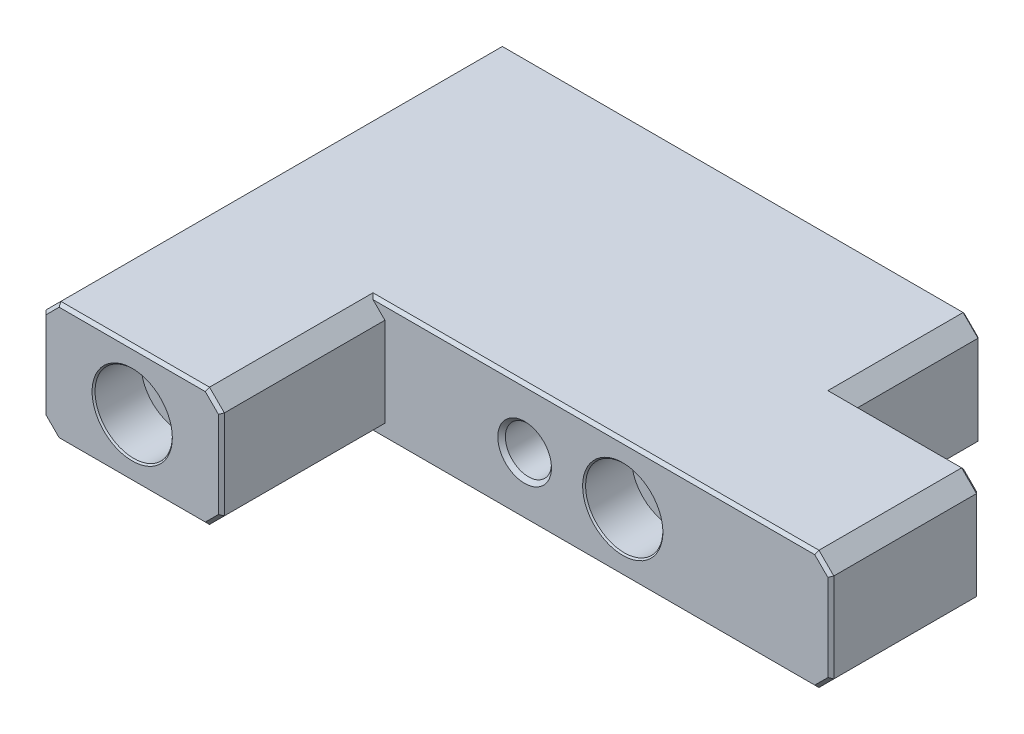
ISO-10303-21;
HEADER;
FILE_DESCRIPTION(('STEP AP214'),'2;1');
FILE_NAME('part.step','',(''),(''),'','','');
FILE_SCHEMA(('AUTOMOTIVE_DESIGN { 1 0 10303 214 1 1 1 1 }'));
ENDSEC;
DATA;
#1=APPLICATION_CONTEXT('core data for automotive mechanical design processes');
#2=APPLICATION_PROTOCOL_DEFINITION('international standard','automotive_design',2000,#1);
#3=PRODUCT_CONTEXT('',#1,'mechanical');
#4=PRODUCT('Part','Part','',(#3));
#5=PRODUCT_RELATED_PRODUCT_CATEGORY('part','',(#4));
#6=PRODUCT_DEFINITION_FORMATION('','',#4);
#7=PRODUCT_DEFINITION_CONTEXT('part definition',#1,'design');
#8=PRODUCT_DEFINITION('design','',#6,#7);
#9=PRODUCT_DEFINITION_SHAPE('','',#8);
#10=(LENGTH_UNIT() NAMED_UNIT(*) SI_UNIT(.MILLI.,.METRE.));
#11=(NAMED_UNIT(*) PLANE_ANGLE_UNIT() SI_UNIT($,.RADIAN.));
#12=(NAMED_UNIT(*) SI_UNIT($,.STERADIAN.) SOLID_ANGLE_UNIT());
#13=UNCERTAINTY_MEASURE_WITH_UNIT(LENGTH_MEASURE(1.E-05),#10,'distance_accuracy_value','');
#14=(GEOMETRIC_REPRESENTATION_CONTEXT(3) GLOBAL_UNCERTAINTY_ASSIGNED_CONTEXT((#13)) GLOBAL_UNIT_ASSIGNED_CONTEXT((#10,
#11,#12)) REPRESENTATION_CONTEXT('',''));
#15=CARTESIAN_POINT('',(0.,0.,0.));
#16=DIRECTION('',(0.,0.,1.));
#17=DIRECTION('',(1.,0.,0.));
#18=AXIS2_PLACEMENT_3D('',#15,#16,#17);
#19=CARTESIAN_POINT('',(210.,40.,150.));
#20=DIRECTION('',(0.,-1.,0.));
#21=DIRECTION('',(1.,0.,0.));
#22=AXIS2_PLACEMENT_3D('',#19,#20,#21);
#23=PLANE('',#22);
#24=DIRECTION('',(0.,0.,-1.));
#25=VECTOR('',#24,1.);
#26=CARTESIAN_POINT('',(160.,40.,150.));
#27=LINE('',#26,#25);
#28=CARTESIAN_POINT('',(160.,40.,46.));
#29=VERTEX_POINT('',#28);
#30=CARTESIAN_POINT('',(160.,40.,0.5));
#31=VERTEX_POINT('',#30);
#32=EDGE_CURVE('E303',#29,#31,#27,.T.);
#33=ORIENTED_EDGE('',*,*,#32,.T.);
#34=DIRECTION('',(-1.,0.,0.));
#35=VECTOR('',#34,1.);
#36=CARTESIAN_POINT('',(210.,40.,0.5));
#37=LINE('',#36,#35);
#38=CARTESIAN_POINT('',(5.,40.,0.5));
#39=VERTEX_POINT('',#38);
#40=EDGE_CURVE('E492',#31,#39,#37,.T.);
#41=ORIENTED_EDGE('',*,*,#40,.T.);
#42=DIRECTION('',(0.,0.,1.));
#43=VECTOR('',#42,1.);
#44=CARTESIAN_POINT('',(5.,40.,150.));
#45=LINE('',#44,#43);
#46=CARTESIAN_POINT('',(5.,40.,149.));
#47=VERTEX_POINT('',#46);
#48=EDGE_CURVE('E296',#39,#47,#45,.T.);
#49=ORIENTED_EDGE('',*,*,#48,.T.);
#50=DIRECTION('',(1.,0.,0.));
#51=VECTOR('',#50,1.);
#52=CARTESIAN_POINT('',(54.9999999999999,40.,149.));
#53=LINE('',#52,#51);
#54=CARTESIAN_POINT('',(54.9999999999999,40.,149.));
#55=VERTEX_POINT('',#54);
#56=EDGE_CURVE('E362',#47,#55,#53,.T.);
#57=ORIENTED_EDGE('',*,*,#56,.T.);
#58=DIRECTION('',(0.,0.,-1.));
#59=VECTOR('',#58,1.);
#60=CARTESIAN_POINT('',(54.9999999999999,40.,150.));
#61=LINE('',#60,#59);
#62=CARTESIAN_POINT('',(54.9999999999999,40.,94.));
#63=VERTEX_POINT('',#62);
#64=EDGE_CURVE('E298',#55,#63,#61,.T.);
#65=ORIENTED_EDGE('',*,*,#64,.T.);
#66=DIRECTION('',(1.,0.,0.));
#67=VECTOR('',#66,1.);
#68=CARTESIAN_POINT('',(210.,40.,94.));
#69=LINE('',#68,#67);
#70=CARTESIAN_POINT('',(205.,40.,94.));
#71=VERTEX_POINT('',#70);
#72=EDGE_CURVE('E364',#63,#71,#69,.T.);
#73=ORIENTED_EDGE('',*,*,#72,.T.);
#74=DIRECTION('',(0.,0.,-1.));
#75=VECTOR('',#74,1.);
#76=CARTESIAN_POINT('',(205.,40.,150.));
#77=LINE('',#76,#75);
#78=CARTESIAN_POINT('',(205.,40.,46.));
#79=VERTEX_POINT('',#78);
#80=EDGE_CURVE('E300',#71,#79,#77,.T.);
#81=ORIENTED_EDGE('',*,*,#80,.T.);
#82=DIRECTION('',(-1.,0.,0.));
#83=VECTOR('',#82,1.);
#84=CARTESIAN_POINT('',(210.,40.,46.));
#85=LINE('',#84,#83);
#86=EDGE_CURVE('E366',#79,#29,#85,.T.);
#87=ORIENTED_EDGE('',*,*,#86,.T.);
#88=EDGE_LOOP('',(#33,#41,#49,#57,#65,#73,#81,#87));
#89=FACE_BOUND('',#88,.T.);
#90=ADVANCED_FACE('F33',(#89),#23,.F.);
#91=CARTESIAN_POINT('',(0.,40.,150.));
#92=DIRECTION('',(1.,0.,0.));
#93=DIRECTION('',(0.,0.,-1.));
#94=AXIS2_PLACEMENT_3D('',#91,#92,#93);
#95=PLANE('',#94);
#96=DIRECTION('',(0.,0.,-1.));
#97=VECTOR('',#96,1.);
#98=CARTESIAN_POINT('',(0.,35.,150.));
#99=LINE('',#98,#97);
#100=CARTESIAN_POINT('',(0.,35.,149.));
#101=VERTEX_POINT('',#100);
#102=CARTESIAN_POINT('',(0.,35.,0.5));
#103=VERTEX_POINT('',#102);
#104=EDGE_CURVE('E317',#101,#103,#99,.T.);
#105=ORIENTED_EDGE('',*,*,#104,.T.);
#106=DIRECTION('',(0.,-1.,0.));
#107=VECTOR('',#106,1.);
#108=CARTESIAN_POINT('',(0.,40.,0.5));
#109=LINE('',#108,#107);
#110=CARTESIAN_POINT('',(0.,5.00000000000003,0.5));
#111=VERTEX_POINT('',#110);
#112=EDGE_CURVE('E496',#103,#111,#109,.T.);
#113=ORIENTED_EDGE('',*,*,#112,.T.);
#114=DIRECTION('',(0.,0.,1.));
#115=VECTOR('',#114,1.);
#116=CARTESIAN_POINT('',(0.,5.00000000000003,150.));
#117=LINE('',#116,#115);
#118=CARTESIAN_POINT('',(0.,5.00000000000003,149.));
#119=VERTEX_POINT('',#118);
#120=EDGE_CURVE('E320',#111,#119,#117,.T.);
#121=ORIENTED_EDGE('',*,*,#120,.T.);
#122=DIRECTION('',(0.,1.,0.));
#123=VECTOR('',#122,1.);
#124=CARTESIAN_POINT('',(0.,35.,149.));
#125=LINE('',#124,#123);
#126=EDGE_CURVE('E408',#119,#101,#125,.T.);
#127=ORIENTED_EDGE('',*,*,#126,.T.);
#128=EDGE_LOOP('',(#105,#113,#121,#127));
#129=FACE_BOUND('',#128,.T.);
#130=ADVANCED_FACE('F572',(#129),#95,.F.);
#131=CARTESIAN_POINT('',(0.,0.,150.));
#132=DIRECTION('',(0.,1.,0.));
#133=DIRECTION('',(0.,0.,1.));
#134=AXIS2_PLACEMENT_3D('',#131,#132,#133);
#135=PLANE('',#134);
#136=CARTESIAN_POINT('',(190.,0.,70.));
#137=DIRECTION('',(0.,-1.,0.));
#138=DIRECTION('',(0.,0.,-1.));
#139=AXIS2_PLACEMENT_3D('',#136,#137,#138);
#140=CIRCLE('',#139,8.025);
#141=CARTESIAN_POINT('',(190.,0.,61.975));
#142=VERTEX_POINT('',#141);
#143=EDGE_CURVE('E255',#142,#142,#140,.T.);
#144=ORIENTED_EDGE('',*,*,#143,.F.);
#145=EDGE_LOOP('',(#144));
#146=FACE_BOUND('',#145,.T.);
#147=DIRECTION('',(0.,0.,-1.));
#148=VECTOR('',#147,1.);
#149=CARTESIAN_POINT('',(5.,0.,150.));
#150=LINE('',#149,#148);
#151=CARTESIAN_POINT('',(5.,0.,149.));
#152=VERTEX_POINT('',#151);
#153=CARTESIAN_POINT('',(5.,0.,0.5));
#154=VERTEX_POINT('',#153);
#155=EDGE_CURVE('E282',#152,#154,#150,.T.);
#156=ORIENTED_EDGE('',*,*,#155,.T.);
#157=DIRECTION('',(1.,0.,0.));
#158=VECTOR('',#157,1.);
#159=CARTESIAN_POINT('',(0.,0.,0.5));
#160=LINE('',#159,#158);
#161=CARTESIAN_POINT('',(160.,0.,0.5));
#162=VERTEX_POINT('',#161);
#163=EDGE_CURVE('E58',#154,#162,#160,.T.);
#164=ORIENTED_EDGE('',*,*,#163,.T.);
#165=DIRECTION('',(0.,0.,1.));
#166=VECTOR('',#165,1.);
#167=CARTESIAN_POINT('',(160.,0.,150.));
#168=LINE('',#167,#166);
#169=CARTESIAN_POINT('',(160.,0.,46.));
#170=VERTEX_POINT('',#169);
#171=EDGE_CURVE('E290',#162,#170,#168,.T.);
#172=ORIENTED_EDGE('',*,*,#171,.T.);
#173=DIRECTION('',(1.,0.,0.));
#174=VECTOR('',#173,1.);
#175=CARTESIAN_POINT('',(0.,0.,46.));
#176=LINE('',#175,#174);
#177=CARTESIAN_POINT('',(205.,0.,46.));
#178=VERTEX_POINT('',#177);
#179=EDGE_CURVE('E337',#170,#178,#176,.T.);
#180=ORIENTED_EDGE('',*,*,#179,.T.);
#181=DIRECTION('',(0.,0.,1.));
#182=VECTOR('',#181,1.);
#183=CARTESIAN_POINT('',(205.,0.,150.));
#184=LINE('',#183,#182);
#185=CARTESIAN_POINT('',(205.,0.,94.));
#186=VERTEX_POINT('',#185);
#187=EDGE_CURVE('E287',#178,#186,#184,.T.);
#188=ORIENTED_EDGE('',*,*,#187,.T.);
#189=DIRECTION('',(-1.,0.,0.));
#190=VECTOR('',#189,1.);
#191=CARTESIAN_POINT('',(0.,0.,94.));
#192=LINE('',#191,#190);
#193=CARTESIAN_POINT('',(55.,0.,94.));
#194=VERTEX_POINT('',#193);
#195=EDGE_CURVE('E334',#186,#194,#192,.T.);
#196=ORIENTED_EDGE('',*,*,#195,.T.);
#197=DIRECTION('',(0.,0.,1.));
#198=VECTOR('',#197,1.);
#199=CARTESIAN_POINT('',(55.,0.,150.));
#200=LINE('',#199,#198);
#201=CARTESIAN_POINT('',(55.,0.,149.));
#202=VERTEX_POINT('',#201);
#203=EDGE_CURVE('E284',#194,#202,#200,.T.);
#204=ORIENTED_EDGE('',*,*,#203,.T.);
#205=DIRECTION('',(-1.,0.,0.));
#206=VECTOR('',#205,1.);
#207=CARTESIAN_POINT('',(5.,0.,149.));
#208=LINE('',#207,#206);
#209=EDGE_CURVE('E332',#202,#152,#208,.T.);
#210=ORIENTED_EDGE('',*,*,#209,.T.);
#211=EDGE_LOOP('',(#156,#164,#172,#180,#188,#196,#204,#210));
#212=FACE_BOUND('',#211,.T.);
#213=ADVANCED_FACE('F554',(#146,#212),#135,.F.);
#214=CARTESIAN_POINT('',(210.,0.,150.));
#215=DIRECTION('',(-1.,0.,0.));
#216=DIRECTION('',(0.,-1.,0.));
#217=AXIS2_PLACEMENT_3D('',#214,#215,#216);
#218=PLANE('',#217);
#219=DIRECTION('',(0.,0.,-1.));
#220=VECTOR('',#219,1.);
#221=CARTESIAN_POINT('',(210.,5.00000000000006,150.));
#222=LINE('',#221,#220);
#223=CARTESIAN_POINT('',(210.,5.00000000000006,94.));
#224=VERTEX_POINT('',#223);
#225=CARTESIAN_POINT('',(210.,5.00000000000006,46.));
#226=VERTEX_POINT('',#225);
#227=EDGE_CURVE('E309',#224,#226,#222,.T.);
#228=ORIENTED_EDGE('',*,*,#227,.T.);
#229=DIRECTION('',(0.,1.,0.));
#230=VECTOR('',#229,1.);
#231=CARTESIAN_POINT('',(210.,0.,46.));
#232=LINE('',#231,#230);
#233=CARTESIAN_POINT('',(210.,35.,46.));
#234=VERTEX_POINT('',#233);
#235=EDGE_CURVE('E356',#226,#234,#232,.T.);
#236=ORIENTED_EDGE('',*,*,#235,.T.);
#237=DIRECTION('',(0.,0.,1.));
#238=VECTOR('',#237,1.);
#239=CARTESIAN_POINT('',(210.,35.,150.));
#240=LINE('',#239,#238);
#241=CARTESIAN_POINT('',(210.,35.,94.));
#242=VERTEX_POINT('',#241);
#243=EDGE_CURVE('E306',#234,#242,#240,.T.);
#244=ORIENTED_EDGE('',*,*,#243,.T.);
#245=DIRECTION('',(0.,-1.,0.));
#246=VECTOR('',#245,1.);
#247=CARTESIAN_POINT('',(210.,0.,94.));
#248=LINE('',#247,#246);
#249=EDGE_CURVE('E354',#242,#224,#248,.T.);
#250=ORIENTED_EDGE('',*,*,#249,.T.);
#251=EDGE_LOOP('',(#228,#236,#244,#250));
#252=FACE_BOUND('',#251,.T.);
#253=ADVANCED_FACE('F620',(#252),#218,.F.);
#254=CARTESIAN_POINT('',(0.,40.,150.));
#255=DIRECTION('',(0.,0.,1.));
#256=DIRECTION('',(1.,0.,0.));
#257=AXIS2_PLACEMENT_3D('',#254,#255,#256);
#258=PLANE('',#257);
#259=CARTESIAN_POINT('',(30.,20.,150.));
#260=DIRECTION('',(0.,0.,1.));
#261=DIRECTION('',(1.,0.,0.));
#262=AXIS2_PLACEMENT_3D('',#259,#260,#261);
#263=CIRCLE('',#262,13.5000000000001);
#264=CARTESIAN_POINT('',(43.5000000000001,20.,150.));
#265=VERTEX_POINT('',#264);
#266=EDGE_CURVE('E11',#265,#265,#263,.F.);
#267=ORIENTED_EDGE('',*,*,#266,.T.);
#268=EDGE_LOOP('',(#267));
#269=FACE_BOUND('',#268,.T.);
#270=DIRECTION('',(-1.,0.,0.));
#271=VECTOR('',#270,1.);
#272=CARTESIAN_POINT('',(5.,39.,150.));
#273=LINE('',#272,#271);
#274=CARTESIAN_POINT('',(54.5857864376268,39.,150.));
#275=VERTEX_POINT('',#274);
#276=CARTESIAN_POINT('',(5.4142135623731,39.,150.));
#277=VERTEX_POINT('',#276);
#278=EDGE_CURVE('E391',#275,#277,#273,.T.);
#279=ORIENTED_EDGE('',*,*,#278,.T.);
#280=DIRECTION('',(-0.707106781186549,-0.707106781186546,0.));
#281=VECTOR('',#280,1.);
#282=CARTESIAN_POINT('',(3.20710678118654,36.7928932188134,150.));
#283=LINE('',#282,#281);
#284=CARTESIAN_POINT('',(1.,34.5857864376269,150.));
#285=VERTEX_POINT('',#284);
#286=EDGE_CURVE('E393',#277,#285,#283,.T.);
#287=ORIENTED_EDGE('',*,*,#286,.T.);
#288=DIRECTION('',(0.,-1.,0.));
#289=VECTOR('',#288,1.);
#290=CARTESIAN_POINT('',(1.,5.00000000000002,150.));
#291=LINE('',#290,#289);
#292=CARTESIAN_POINT('',(1.,5.41421356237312,150.));
#293=VERTEX_POINT('',#292);
#294=EDGE_CURVE('E379',#285,#293,#291,.T.);
#295=ORIENTED_EDGE('',*,*,#294,.T.);
#296=DIRECTION('',(0.707106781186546,-0.707106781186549,0.));
#297=VECTOR('',#296,1.);
#298=CARTESIAN_POINT('',(-16.7928932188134,23.2071067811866,150.));
#299=LINE('',#298,#297);
#300=CARTESIAN_POINT('',(5.4142135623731,1.,150.));
#301=VERTEX_POINT('',#300);
#302=EDGE_CURVE('E381',#293,#301,#299,.T.);
#303=ORIENTED_EDGE('',*,*,#302,.T.);
#304=DIRECTION('',(1.,0.,0.));
#305=VECTOR('',#304,1.);
#306=CARTESIAN_POINT('',(55.,1.,150.));
#307=LINE('',#306,#305);
#308=CARTESIAN_POINT('',(54.5857864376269,1.,150.));
#309=VERTEX_POINT('',#308);
#310=EDGE_CURVE('E383',#301,#309,#307,.T.);
#311=ORIENTED_EDGE('',*,*,#310,.T.);
#312=DIRECTION('',(0.707106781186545,0.70710678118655,0.));
#313=VECTOR('',#312,1.);
#314=CARTESIAN_POINT('',(46.7928932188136,-6.79289321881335,150.));
#315=LINE('',#314,#313);
#316=CARTESIAN_POINT('',(59.,5.41421356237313,150.));
#317=VERTEX_POINT('',#316);
#318=EDGE_CURVE('E385',#309,#317,#315,.T.);
#319=ORIENTED_EDGE('',*,*,#318,.T.);
#320=DIRECTION('',(0.,1.,0.));
#321=VECTOR('',#320,1.);
#322=CARTESIAN_POINT('',(59.,35.,150.));
#323=LINE('',#322,#321);
#324=CARTESIAN_POINT('',(59.,34.5857864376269,150.));
#325=VERTEX_POINT('',#324);
#326=EDGE_CURVE('E387',#317,#325,#323,.T.);
#327=ORIENTED_EDGE('',*,*,#326,.T.);
#328=DIRECTION('',(-0.707106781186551,0.707106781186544,0.));
#329=VECTOR('',#328,1.);
#330=CARTESIAN_POINT('',(26.7928932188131,66.7928932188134,150.));
#331=LINE('',#330,#329);
#332=EDGE_CURVE('E389',#325,#275,#331,.T.);
#333=ORIENTED_EDGE('',*,*,#332,.T.);
#334=EDGE_LOOP('',(#279,#287,#295,#303,#311,#319,#327,#333));
#335=FACE_BOUND('',#334,.T.);
#336=ADVANCED_FACE('F617',(#269,#335),#258,.T.);
#337=CARTESIAN_POINT('',(0.,40.,0.));
#338=DIRECTION('',(0.,0.,1.));
#339=DIRECTION('',(1.,0.,0.));
#340=AXIS2_PLACEMENT_3D('',#337,#338,#339);
#341=PLANE('',#340);
#342=DIRECTION('',(1.,0.,0.));
#343=VECTOR('',#342,1.);
#344=CARTESIAN_POINT('',(0.,39.5,0.));
#345=LINE('',#344,#343);
#346=CARTESIAN_POINT('',(5.20710678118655,39.5,0.));
#347=VERTEX_POINT('',#346);
#348=CARTESIAN_POINT('',(159.792893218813,39.5,0.));
#349=VERTEX_POINT('',#348);
#350=EDGE_CURVE('E484',#347,#349,#345,.T.);
#351=ORIENTED_EDGE('',*,*,#350,.T.);
#352=DIRECTION('',(0.707106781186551,-0.707106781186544,0.));
#353=VECTOR('',#352,1.);
#354=CARTESIAN_POINT('',(164.646446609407,34.6464466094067,0.));
#355=LINE('',#354,#353);
#356=CARTESIAN_POINT('',(164.5,34.7928932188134,0.));
#357=VERTEX_POINT('',#356);
#358=EDGE_CURVE('E486',#349,#357,#355,.T.);
#359=ORIENTED_EDGE('',*,*,#358,.T.);
#360=DIRECTION('',(0.,-1.,0.));
#361=VECTOR('',#360,1.);
#362=CARTESIAN_POINT('',(164.5,40.,0.));
#363=LINE('',#362,#361);
#364=CARTESIAN_POINT('',(164.5,5.20710678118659,0.));
#365=VERTEX_POINT('',#364);
#366=EDGE_CURVE('E472',#357,#365,#363,.T.);
#367=ORIENTED_EDGE('',*,*,#366,.T.);
#368=DIRECTION('',(-0.707106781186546,-0.707106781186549,0.));
#369=VECTOR('',#368,1.);
#370=CARTESIAN_POINT('',(159.646446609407,0.353553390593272,0.));
#371=LINE('',#370,#369);
#372=CARTESIAN_POINT('',(159.792893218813,0.499999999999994,0.));
#373=VERTEX_POINT('',#372);
#374=EDGE_CURVE('E474',#365,#373,#371,.T.);
#375=ORIENTED_EDGE('',*,*,#374,.T.);
#376=DIRECTION('',(-1.,0.,0.));
#377=VECTOR('',#376,1.);
#378=CARTESIAN_POINT('',(0.,0.5,0.));
#379=LINE('',#378,#377);
#380=CARTESIAN_POINT('',(5.20710678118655,0.5,0.));
#381=VERTEX_POINT('',#380);
#382=EDGE_CURVE('E476',#373,#381,#379,.T.);
#383=ORIENTED_EDGE('',*,*,#382,.T.);
#384=DIRECTION('',(-0.707106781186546,0.707106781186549,0.));
#385=VECTOR('',#384,1.);
#386=CARTESIAN_POINT('',(0.353553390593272,5.3535533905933,0.));
#387=LINE('',#386,#385);
#388=CARTESIAN_POINT('',(0.500000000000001,5.20710678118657,0.));
#389=VERTEX_POINT('',#388);
#390=EDGE_CURVE('E478',#381,#389,#387,.T.);
#391=ORIENTED_EDGE('',*,*,#390,.T.);
#392=DIRECTION('',(0.,1.,0.));
#393=VECTOR('',#392,1.);
#394=CARTESIAN_POINT('',(0.5,40.,0.));
#395=LINE('',#394,#393);
#396=CARTESIAN_POINT('',(0.5,34.7928932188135,0.));
#397=VERTEX_POINT('',#396);
#398=EDGE_CURVE('E480',#389,#397,#395,.T.);
#399=ORIENTED_EDGE('',*,*,#398,.T.);
#400=DIRECTION('',(0.707106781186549,0.707106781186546,0.));
#401=VECTOR('',#400,1.);
#402=CARTESIAN_POINT('',(5.35355339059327,39.6464466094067,0.));
#403=LINE('',#402,#401);
#404=EDGE_CURVE('E482',#397,#347,#403,.T.);
#405=ORIENTED_EDGE('',*,*,#404,.T.);
#406=EDGE_LOOP('',(#351,#359,#367,#375,#383,#391,#399,#405));
#407=FACE_BOUND('',#406,.T.);
#408=CARTESIAN_POINT('',(140.,20.,0.));
#409=DIRECTION('',(0.,0.,1.));
#410=DIRECTION('',(1.,0.,0.));
#411=AXIS2_PLACEMENT_3D('',#408,#409,#410);
#412=CIRCLE('',#411,9.24999999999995);
#413=CARTESIAN_POINT('',(149.25,20.,0.));
#414=VERTEX_POINT('',#413);
#415=EDGE_CURVE('E469',#414,#414,#412,.T.);
#416=ORIENTED_EDGE('',*,*,#415,.T.);
#417=EDGE_LOOP('',(#416));
#418=FACE_BOUND('',#417,.T.);
#419=CARTESIAN_POINT('',(30.,20.,0.));
#420=DIRECTION('',(0.,0.,1.));
#421=DIRECTION('',(1.,0.,0.));
#422=AXIS2_PLACEMENT_3D('',#419,#420,#421);
#423=CIRCLE('',#422,9.24999999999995);
#424=CARTESIAN_POINT('',(39.25,20.,0.));
#425=VERTEX_POINT('',#424);
#426=EDGE_CURVE('E420',#425,#425,#423,.T.);
#427=ORIENTED_EDGE('',*,*,#426,.T.);
#428=EDGE_LOOP('',(#427));
#429=FACE_BOUND('',#428,.T.);
#430=ADVANCED_FACE('F619',(#407,#418,#429),#341,.F.);
#431=CARTESIAN_POINT('',(230.,0.,95.));
#432=DIRECTION('',(0.,0.,-1.));
#433=DIRECTION('',(-1.,0.,0.));
#434=AXIS2_PLACEMENT_3D('',#431,#432,#433);
#435=PLANE('',#434);
#436=CARTESIAN_POINT('',(140.,20.,95.));
#437=DIRECTION('',(0.,0.,-1.));
#438=DIRECTION('',(-1.,0.,0.));
#439=AXIS2_PLACEMENT_3D('',#436,#437,#438);
#440=CIRCLE('',#439,13.5);
#441=CARTESIAN_POINT('',(126.5,20.,95.));
#442=VERTEX_POINT('',#441);
#443=EDGE_CURVE('E513',#442,#442,#440,.T.);
#444=ORIENTED_EDGE('',*,*,#443,.T.);
#445=EDGE_LOOP('',(#444));
#446=FACE_BOUND('',#445,.T.);
#447=CARTESIAN_POINT('',(107.,20.,95.));
#448=DIRECTION('',(0.,0.,1.));
#449=DIRECTION('',(0.,-1.,0.));
#450=AXIS2_PLACEMENT_3D('',#447,#448,#449);
#451=CIRCLE('',#450,9.02500000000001);
#452=CARTESIAN_POINT('',(107.,10.975,95.));
#453=VERTEX_POINT('',#452);
#454=EDGE_CURVE('E248',#453,#453,#451,.T.);
#455=ORIENTED_EDGE('',*,*,#454,.F.);
#456=EDGE_LOOP('',(#455));
#457=FACE_BOUND('',#456,.T.);
#458=DIRECTION('',(0.707106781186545,0.70710678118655,0.));
#459=VECTOR('',#458,1.);
#460=CARTESIAN_POINT('',(142.499999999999,87.5,95.));
#461=LINE('',#460,#459);
#462=CARTESIAN_POINT('',(60.,5.00000000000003,95.));
#463=VERTEX_POINT('',#462);
#464=CARTESIAN_POINT('',(56.,1.00000000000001,95.));
#465=VERTEX_POINT('',#464);
#466=EDGE_CURVE('E329',#463,#465,#461,.F.);
#467=ORIENTED_EDGE('',*,*,#466,.T.);
#468=DIRECTION('',(1.,0.,0.));
#469=VECTOR('',#468,1.);
#470=CARTESIAN_POINT('',(230.,1.00000000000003,95.));
#471=LINE('',#470,#469);
#472=CARTESIAN_POINT('',(204.585786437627,1.00000000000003,95.));
#473=VERTEX_POINT('',#472);
#474=EDGE_CURVE('E377',#465,#473,#471,.T.);
#475=ORIENTED_EDGE('',*,*,#474,.T.);
#476=DIRECTION('',(0.707106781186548,0.707106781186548,0.));
#477=VECTOR('',#476,1.);
#478=CARTESIAN_POINT('',(209.292893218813,5.70710678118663,95.));
#479=LINE('',#478,#477);
#480=CARTESIAN_POINT('',(209.,5.41421356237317,95.));
#481=VERTEX_POINT('',#480);
#482=EDGE_CURVE('E375',#473,#481,#479,.T.);
#483=ORIENTED_EDGE('',*,*,#482,.T.);
#484=DIRECTION('',(0.,1.,0.));
#485=VECTOR('',#484,1.);
#486=CARTESIAN_POINT('',(209.,0.,95.));
#487=LINE('',#486,#485);
#488=CARTESIAN_POINT('',(209.,34.5857864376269,95.));
#489=VERTEX_POINT('',#488);
#490=EDGE_CURVE('E373',#481,#489,#487,.T.);
#491=ORIENTED_EDGE('',*,*,#490,.T.);
#492=DIRECTION('',(-0.707106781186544,0.707106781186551,0.));
#493=VECTOR('',#492,1.);
#494=CARTESIAN_POINT('',(204.292893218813,39.2928932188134,95.));
#495=LINE('',#494,#493);
#496=CARTESIAN_POINT('',(204.585786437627,39.,95.));
#497=VERTEX_POINT('',#496);
#498=EDGE_CURVE('E371',#489,#497,#495,.T.);
#499=ORIENTED_EDGE('',*,*,#498,.T.);
#500=DIRECTION('',(-1.,0.,0.));
#501=VECTOR('',#500,1.);
#502=CARTESIAN_POINT('',(230.,39.,95.));
#503=LINE('',#502,#501);
#504=CARTESIAN_POINT('',(56.,38.9999999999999,95.));
#505=VERTEX_POINT('',#504);
#506=EDGE_CURVE('E369',#497,#505,#503,.T.);
#507=ORIENTED_EDGE('',*,*,#506,.T.);
#508=DIRECTION('',(-0.707106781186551,0.707106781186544,0.));
#509=VECTOR('',#508,1.);
#510=CARTESIAN_POINT('',(162.500000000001,-67.4999999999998,95.));
#511=LINE('',#510,#509);
#512=CARTESIAN_POINT('',(60.,35.,95.));
#513=VERTEX_POINT('',#512);
#514=EDGE_CURVE('E327',#505,#513,#511,.F.);
#515=ORIENTED_EDGE('',*,*,#514,.T.);
#516=DIRECTION('',(0.,1.,0.));
#517=VECTOR('',#516,1.);
#518=CARTESIAN_POINT('',(60.,0.,95.));
#519=LINE('',#518,#517);
#520=EDGE_CURVE('E279',#463,#513,#519,.T.);
#521=ORIENTED_EDGE('',*,*,#520,.F.);
#522=EDGE_LOOP('',(#467,#475,#483,#491,#499,#507,#515,#521));
#523=FACE_BOUND('',#522,.T.);
#524=ADVANCED_FACE('F627',(#446,#457,#523),#435,.F.);
#525=CARTESIAN_POINT('',(60.,0.,170.));
#526=DIRECTION('',(-1.,0.,0.));
#527=DIRECTION('',(0.,-1.,0.));
#528=AXIS2_PLACEMENT_3D('',#525,#526,#527);
#529=PLANE('',#528);
#530=DIRECTION('',(0.,0.,1.));
#531=VECTOR('',#530,1.);
#532=CARTESIAN_POINT('',(60.,35.,170.));
#533=LINE('',#532,#531);
#534=CARTESIAN_POINT('',(60.,35.,149.));
#535=VERTEX_POINT('',#534);
#536=EDGE_CURVE('E314',#513,#535,#533,.T.);
#537=ORIENTED_EDGE('',*,*,#536,.T.);
#538=DIRECTION('',(0.,-1.,0.));
#539=VECTOR('',#538,1.);
#540=CARTESIAN_POINT('',(60.,5.00000000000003,149.));
#541=LINE('',#540,#539);
#542=CARTESIAN_POINT('',(60.,5.00000000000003,149.));
#543=VERTEX_POINT('',#542);
#544=EDGE_CURVE('E401',#535,#543,#541,.T.);
#545=ORIENTED_EDGE('',*,*,#544,.T.);
#546=DIRECTION('',(0.,0.,-1.));
#547=VECTOR('',#546,1.);
#548=CARTESIAN_POINT('',(60.,5.00000000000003,170.));
#549=LINE('',#548,#547);
#550=EDGE_CURVE('E312',#543,#463,#549,.T.);
#551=ORIENTED_EDGE('',*,*,#550,.T.);
#552=ORIENTED_EDGE('',*,*,#520,.T.);
#553=EDGE_LOOP('',(#537,#545,#551,#552));
#554=FACE_BOUND('',#553,.T.);
#555=ADVANCED_FACE('F607',(#554),#529,.F.);
#556=CARTESIAN_POINT('',(165.,0.,45.));
#557=DIRECTION('',(0.,0.,1.));
#558=DIRECTION('',(1.,0.,0.));
#559=AXIS2_PLACEMENT_3D('',#556,#557,#558);
#560=PLANE('',#559);
#561=DIRECTION('',(-0.707106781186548,-0.707106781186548,0.));
#562=VECTOR('',#561,1.);
#563=CARTESIAN_POINT('',(204.292893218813,0.707106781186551,45.));
#564=LINE('',#563,#562);
#565=CARTESIAN_POINT('',(209.,5.41421356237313,45.));
#566=VERTEX_POINT('',#565);
#567=CARTESIAN_POINT('',(204.585786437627,1.,45.));
#568=VERTEX_POINT('',#567);
#569=EDGE_CURVE('E346',#566,#568,#564,.T.);
#570=ORIENTED_EDGE('',*,*,#569,.T.);
#571=DIRECTION('',(-1.,0.,0.));
#572=VECTOR('',#571,1.);
#573=CARTESIAN_POINT('',(165.,1.,45.));
#574=LINE('',#573,#572);
#575=CARTESIAN_POINT('',(161.,0.999999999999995,45.));
#576=VERTEX_POINT('',#575);
#577=EDGE_CURVE('E348',#568,#576,#574,.T.);
#578=ORIENTED_EDGE('',*,*,#577,.T.);
#579=DIRECTION('',(-0.707106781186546,-0.707106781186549,0.));
#580=VECTOR('',#579,1.);
#581=CARTESIAN_POINT('',(162.5,2.5,45.));
#582=LINE('',#581,#580);
#583=CARTESIAN_POINT('',(165.,5.00000000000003,45.));
#584=VERTEX_POINT('',#583);
#585=EDGE_CURVE('E322',#576,#584,#582,.F.);
#586=ORIENTED_EDGE('',*,*,#585,.T.);
#587=DIRECTION('',(0.,1.,0.));
#588=VECTOR('',#587,1.);
#589=CARTESIAN_POINT('',(165.,0.,45.));
#590=LINE('',#589,#588);
#591=CARTESIAN_POINT('',(165.,35.,45.));
#592=VERTEX_POINT('',#591);
#593=EDGE_CURVE('E276',#584,#592,#590,.T.);
#594=ORIENTED_EDGE('',*,*,#593,.T.);
#595=DIRECTION('',(0.707106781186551,-0.707106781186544,0.));
#596=VECTOR('',#595,1.);
#597=CARTESIAN_POINT('',(182.5,17.5000000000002,45.));
#598=LINE('',#597,#596);
#599=CARTESIAN_POINT('',(161.,39.,45.));
#600=VERTEX_POINT('',#599);
#601=EDGE_CURVE('E324',#592,#600,#598,.F.);
#602=ORIENTED_EDGE('',*,*,#601,.T.);
#603=DIRECTION('',(1.,0.,0.));
#604=VECTOR('',#603,1.);
#605=CARTESIAN_POINT('',(165.,39.,45.));
#606=LINE('',#605,#604);
#607=CARTESIAN_POINT('',(204.585786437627,39.,45.));
#608=VERTEX_POINT('',#607);
#609=EDGE_CURVE('E340',#600,#608,#606,.T.);
#610=ORIENTED_EDGE('',*,*,#609,.T.);
#611=DIRECTION('',(0.707106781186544,-0.707106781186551,0.));
#612=VECTOR('',#611,1.);
#613=CARTESIAN_POINT('',(209.292893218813,34.2928932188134,45.));
#614=LINE('',#613,#612);
#615=CARTESIAN_POINT('',(209.,34.5857864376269,45.));
#616=VERTEX_POINT('',#615);
#617=EDGE_CURVE('E342',#608,#616,#614,.T.);
#618=ORIENTED_EDGE('',*,*,#617,.T.);
#619=DIRECTION('',(0.,-1.,0.));
#620=VECTOR('',#619,1.);
#621=CARTESIAN_POINT('',(209.,0.,45.));
#622=LINE('',#621,#620);
#623=EDGE_CURVE('E344',#616,#566,#622,.T.);
#624=ORIENTED_EDGE('',*,*,#623,.T.);
#625=EDGE_LOOP('',(#570,#578,#586,#594,#602,#610,#618,#624));
#626=FACE_BOUND('',#625,.T.);
#627=ADVANCED_FACE('F787',(#626),#560,.F.);
#628=CARTESIAN_POINT('',(165.,0.,-25.));
#629=DIRECTION('',(-1.,0.,0.));
#630=DIRECTION('',(0.,-1.,0.));
#631=AXIS2_PLACEMENT_3D('',#628,#629,#630);
#632=PLANE('',#631);
#633=DIRECTION('',(0.,0.,-1.));
#634=VECTOR('',#633,1.);
#635=CARTESIAN_POINT('',(165.,5.00000000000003,-25.));
#636=LINE('',#635,#634);
#637=CARTESIAN_POINT('',(165.,5.00000000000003,0.5));
#638=VERTEX_POINT('',#637);
#639=EDGE_CURVE('E294',#584,#638,#636,.T.);
#640=ORIENTED_EDGE('',*,*,#639,.T.);
#641=DIRECTION('',(0.,1.,0.));
#642=VECTOR('',#641,1.);
#643=CARTESIAN_POINT('',(165.,0.,0.5));
#644=LINE('',#643,#642);
#645=CARTESIAN_POINT('',(165.,35.,0.5));
#646=VERTEX_POINT('',#645);
#647=EDGE_CURVE('E502',#638,#646,#644,.T.);
#648=ORIENTED_EDGE('',*,*,#647,.T.);
#649=DIRECTION('',(0.,0.,1.));
#650=VECTOR('',#649,1.);
#651=CARTESIAN_POINT('',(165.,35.,-25.));
#652=LINE('',#651,#650);
#653=EDGE_CURVE('E292',#646,#592,#652,.T.);
#654=ORIENTED_EDGE('',*,*,#653,.T.);
#655=ORIENTED_EDGE('',*,*,#593,.F.);
#656=EDGE_LOOP('',(#640,#648,#654,#655));
#657=FACE_BOUND('',#656,.T.);
#658=ADVANCED_FACE('F781',(#657),#632,.F.);
#659=CARTESIAN_POINT('',(140.,20.,95.));
#660=DIRECTION('',(0.,0.,1.));
#661=DIRECTION('',(0.,-1.,0.));
#662=AXIS2_PLACEMENT_3D('',#659,#660,#661);
#663=CYLINDRICAL_SURFACE('',#662,8.74999999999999);
#664=CARTESIAN_POINT('',(140.,20.,0.499999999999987));
#665=DIRECTION('',(0.,0.,1.));
#666=DIRECTION('',(1.,0.,0.));
#667=AXIS2_PLACEMENT_3D('',#664,#665,#666);
#668=CIRCLE('',#667,8.74999999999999);
#669=CARTESIAN_POINT('',(148.75,20.,0.499999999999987));
#670=VERTEX_POINT('',#669);
#671=EDGE_CURVE('E504',#670,#670,#668,.F.);
#672=ORIENTED_EDGE('',*,*,#671,.T.);
#673=EDGE_LOOP('',(#672));
#674=FACE_BOUND('',#673,.T.);
#675=CARTESIAN_POINT('',(140.,20.,79.));
#676=DIRECTION('',(0.,0.,1.));
#677=DIRECTION('',(0.,-1.,0.));
#678=AXIS2_PLACEMENT_3D('',#675,#676,#677);
#679=CIRCLE('',#678,8.75000000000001);
#680=CARTESIAN_POINT('',(140.,11.25,79.));
#681=VERTEX_POINT('',#680);
#682=EDGE_CURVE('E273',#681,#681,#679,.T.);
#683=ORIENTED_EDGE('',*,*,#682,.T.);
#684=EDGE_LOOP('',(#683));
#685=FACE_BOUND('',#684,.T.);
#686=ADVANCED_FACE('F775',(#674,#685),#663,.F.);
#687=CARTESIAN_POINT('',(148.75,20.,79.));
#688=DIRECTION('',(0.,0.,-1.));
#689=DIRECTION('',(0.,1.,0.));
#690=AXIS2_PLACEMENT_3D('',#687,#688,#689);
#691=PLANE('',#690);
#692=ORIENTED_EDGE('',*,*,#682,.F.);
#693=EDGE_LOOP('',(#692));
#694=FACE_BOUND('',#693,.T.);
#695=CARTESIAN_POINT('',(140.,20.,79.));
#696=DIRECTION('',(0.,0.,1.));
#697=DIRECTION('',(0.,-1.,0.));
#698=AXIS2_PLACEMENT_3D('',#695,#696,#697);
#699=CIRCLE('',#698,13.);
#700=CARTESIAN_POINT('',(140.,7.00000000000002,79.));
#701=VERTEX_POINT('',#700);
#702=EDGE_CURVE('E270',#701,#701,#699,.T.);
#703=ORIENTED_EDGE('',*,*,#702,.T.);
#704=EDGE_LOOP('',(#703));
#705=FACE_BOUND('',#704,.T.);
#706=ADVANCED_FACE('F770',(#694,#705),#691,.F.);
#707=CARTESIAN_POINT('',(140.,20.,95.));
#708=DIRECTION('',(0.,0.,1.));
#709=DIRECTION('',(0.,-1.,0.));
#710=AXIS2_PLACEMENT_3D('',#707,#708,#709);
#711=CYLINDRICAL_SURFACE('',#710,13.);
#712=CARTESIAN_POINT('',(140.,20.,94.5));
#713=DIRECTION('',(0.,0.,-1.));
#714=DIRECTION('',(-1.,0.,0.));
#715=AXIS2_PLACEMENT_3D('',#712,#713,#714);
#716=CIRCLE('',#715,13.);
#717=CARTESIAN_POINT('',(127.,20.,94.5));
#718=VERTEX_POINT('',#717);
#719=EDGE_CURVE('E510',#718,#718,#716,.F.);
#720=ORIENTED_EDGE('',*,*,#719,.T.);
#721=EDGE_LOOP('',(#720));
#722=FACE_BOUND('',#721,.T.);
#723=ORIENTED_EDGE('',*,*,#702,.F.);
#724=EDGE_LOOP('',(#723));
#725=FACE_BOUND('',#724,.T.);
#726=ADVANCED_FACE('F766',(#722,#725),#711,.F.);
#727=CARTESIAN_POINT('',(30.,20.,150.));
#728=DIRECTION('',(0.,0.,1.));
#729=DIRECTION('',(1.,0.,0.));
#730=AXIS2_PLACEMENT_3D('',#727,#728,#729);
#731=CYLINDRICAL_SURFACE('',#730,8.74999999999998);
#732=CARTESIAN_POINT('',(30.,20.,0.499999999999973));
#733=DIRECTION('',(0.,0.,1.));
#734=DIRECTION('',(1.,0.,0.));
#735=AXIS2_PLACEMENT_3D('',#732,#733,#734);
#736=CIRCLE('',#735,8.74999999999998);
#737=CARTESIAN_POINT('',(38.75,20.,0.499999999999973));
#738=VERTEX_POINT('',#737);
#739=EDGE_CURVE('E507',#738,#738,#736,.F.);
#740=ORIENTED_EDGE('',*,*,#739,.T.);
#741=EDGE_LOOP('',(#740));
#742=FACE_BOUND('',#741,.T.);
#743=CARTESIAN_POINT('',(30.,20.,134.));
#744=DIRECTION('',(0.,0.,1.));
#745=DIRECTION('',(1.,0.,0.));
#746=AXIS2_PLACEMENT_3D('',#743,#744,#745);
#747=CIRCLE('',#746,8.75000000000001);
#748=CARTESIAN_POINT('',(38.75,20.,134.));
#749=VERTEX_POINT('',#748);
#750=EDGE_CURVE('E267',#749,#749,#747,.T.);
#751=ORIENTED_EDGE('',*,*,#750,.T.);
#752=EDGE_LOOP('',(#751));
#753=FACE_BOUND('',#752,.T.);
#754=ADVANCED_FACE('F769',(#742,#753),#731,.F.);
#755=CARTESIAN_POINT('',(38.75,20.,134.));
#756=DIRECTION('',(0.,0.,-1.));
#757=DIRECTION('',(-1.,0.,0.));
#758=AXIS2_PLACEMENT_3D('',#755,#756,#757);
#759=PLANE('',#758);
#760=ORIENTED_EDGE('',*,*,#750,.F.);
#761=EDGE_LOOP('',(#760));
#762=FACE_BOUND('',#761,.T.);
#763=CARTESIAN_POINT('',(30.,20.,134.));
#764=DIRECTION('',(0.,0.,1.));
#765=DIRECTION('',(1.,0.,0.));
#766=AXIS2_PLACEMENT_3D('',#763,#764,#765);
#767=CIRCLE('',#766,13.);
#768=CARTESIAN_POINT('',(43.,20.,134.));
#769=VERTEX_POINT('',#768);
#770=EDGE_CURVE('E264',#769,#769,#767,.T.);
#771=ORIENTED_EDGE('',*,*,#770,.T.);
#772=EDGE_LOOP('',(#771));
#773=FACE_BOUND('',#772,.T.);
#774=ADVANCED_FACE('F879',(#762,#773),#759,.F.);
#775=CARTESIAN_POINT('',(30.,20.,150.));
#776=DIRECTION('',(0.,0.,1.));
#777=DIRECTION('',(1.,0.,0.));
#778=AXIS2_PLACEMENT_3D('',#775,#776,#777);
#779=CYLINDRICAL_SURFACE('',#778,13.);
#780=CARTESIAN_POINT('',(30.,20.,149.5));
#781=DIRECTION('',(0.,0.,1.));
#782=DIRECTION('',(1.,0.,0.));
#783=AXIS2_PLACEMENT_3D('',#780,#781,#782);
#784=CIRCLE('',#783,13.);
#785=CARTESIAN_POINT('',(43.,20.,149.5));
#786=VERTEX_POINT('',#785);
#787=EDGE_CURVE('E42',#786,#786,#784,.T.);
#788=ORIENTED_EDGE('',*,*,#787,.T.);
#789=EDGE_LOOP('',(#788));
#790=FACE_BOUND('',#789,.T.);
#791=ORIENTED_EDGE('',*,*,#770,.F.);
#792=EDGE_LOOP('',(#791));
#793=FACE_BOUND('',#792,.T.);
#794=ADVANCED_FACE('F875',(#790,#793),#779,.F.);
#795=CARTESIAN_POINT('',(107.,20.,46.5));
#796=DIRECTION('',(0.,0.,1.));
#797=DIRECTION('',(0.,-1.,0.));
#798=AXIS2_PLACEMENT_3D('',#795,#796,#797);
#799=CONICAL_SURFACE('',#798,7.74999999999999,1.02974425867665);
#800=CARTESIAN_POINT('',(107.,20.,41.8433302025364));
#801=VERTEX_POINT('',#800);
#802=VERTEX_LOOP('',#801);
#803=FACE_BOUND('',#802,.T.);
#804=CARTESIAN_POINT('',(107.,20.,46.5));
#805=DIRECTION('',(0.,0.,1.));
#806=DIRECTION('',(0.,-1.,0.));
#807=AXIS2_PLACEMENT_3D('',#804,#805,#806);
#808=CIRCLE('',#807,7.74999999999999);
#809=CARTESIAN_POINT('',(107.,12.25,46.5));
#810=VERTEX_POINT('',#809);
#811=EDGE_CURVE('E261',#810,#810,#808,.T.);
#812=ORIENTED_EDGE('',*,*,#811,.T.);
#813=EDGE_LOOP('',(#812));
#814=FACE_BOUND('',#813,.T.);
#815=ADVANCED_FACE('F867',(#803,#814),#799,.F.);
#816=CARTESIAN_POINT('',(107.,20.,95.));
#817=DIRECTION('',(0.,0.,1.));
#818=DIRECTION('',(0.,-1.,0.));
#819=AXIS2_PLACEMENT_3D('',#816,#817,#818);
#820=CYLINDRICAL_SURFACE('',#819,7.74999999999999);
#821=ORIENTED_EDGE('',*,*,#811,.F.);
#822=EDGE_LOOP('',(#821));
#823=FACE_BOUND('',#822,.T.);
#824=CARTESIAN_POINT('',(107.,20.,93.7250000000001));
#825=DIRECTION('',(0.,0.,1.));
#826=DIRECTION('',(0.,-1.,0.));
#827=AXIS2_PLACEMENT_3D('',#824,#825,#826);
#828=CIRCLE('',#827,7.74999999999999);
#829=CARTESIAN_POINT('',(107.,12.25,93.7250000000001));
#830=VERTEX_POINT('',#829);
#831=EDGE_CURVE('E252',#830,#830,#828,.T.);
#832=ORIENTED_EDGE('',*,*,#831,.T.);
#833=EDGE_LOOP('',(#832));
#834=FACE_BOUND('',#833,.T.);
#835=ADVANCED_FACE('F861',(#823,#834),#820,.F.);
#836=CARTESIAN_POINT('',(107.,20.,95.));
#837=DIRECTION('',(0.,0.,1.));
#838=DIRECTION('',(0.,-1.,0.));
#839=AXIS2_PLACEMENT_3D('',#836,#837,#838);
#840=CONICAL_SURFACE('',#839,9.02500000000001,0.785398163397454);
#841=ORIENTED_EDGE('',*,*,#831,.F.);
#842=EDGE_LOOP('',(#841));
#843=FACE_BOUND('',#842,.T.);
#844=ORIENTED_EDGE('',*,*,#454,.T.);
#845=EDGE_LOOP('',(#844));
#846=FACE_BOUND('',#845,.T.);
#847=ADVANCED_FACE('F242',(#843,#846),#840,.F.);
#848=CARTESIAN_POINT('',(190.,25.,70.));
#849=DIRECTION('',(0.,-1.,0.));
#850=DIRECTION('',(0.,0.,-1.));
#851=AXIS2_PLACEMENT_3D('',#848,#849,#850);
#852=CONICAL_SURFACE('',#851,7.00000000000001,1.02974425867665);
#853=CARTESIAN_POINT('',(190.,29.2060243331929,70.));
#854=VERTEX_POINT('',#853);
#855=VERTEX_LOOP('',#854);
#856=FACE_BOUND('',#855,.T.);
#857=CARTESIAN_POINT('',(190.,25.,70.));
#858=DIRECTION('',(0.,-1.,0.));
#859=DIRECTION('',(0.,0.,-1.));
#860=AXIS2_PLACEMENT_3D('',#857,#858,#859);
#861=CIRCLE('',#860,7.00000000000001);
#862=CARTESIAN_POINT('',(190.,25.,63.));
#863=VERTEX_POINT('',#862);
#864=EDGE_CURVE('E246',#863,#863,#861,.T.);
#865=ORIENTED_EDGE('',*,*,#864,.T.);
#866=EDGE_LOOP('',(#865));
#867=FACE_BOUND('',#866,.T.);
#868=ADVANCED_FACE('F238',(#856,#867),#852,.F.);
#869=CARTESIAN_POINT('',(190.,0.,70.));
#870=DIRECTION('',(0.,-1.,0.));
#871=DIRECTION('',(0.,0.,-1.));
#872=AXIS2_PLACEMENT_3D('',#869,#870,#871);
#873=CYLINDRICAL_SURFACE('',#872,7.00000000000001);
#874=ORIENTED_EDGE('',*,*,#864,.F.);
#875=EDGE_LOOP('',(#874));
#876=FACE_BOUND('',#875,.T.);
#877=CARTESIAN_POINT('',(190.,1.02500000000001,70.));
#878=DIRECTION('',(0.,-1.,0.));
#879=DIRECTION('',(0.,0.,-1.));
#880=AXIS2_PLACEMENT_3D('',#877,#878,#879);
#881=CIRCLE('',#880,7.00000000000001);
#882=CARTESIAN_POINT('',(190.,1.02500000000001,63.));
#883=VERTEX_POINT('',#882);
#884=EDGE_CURVE('E249',#883,#883,#881,.T.);
#885=ORIENTED_EDGE('',*,*,#884,.T.);
#886=EDGE_LOOP('',(#885));
#887=FACE_BOUND('',#886,.T.);
#888=ADVANCED_FACE('F241',(#876,#887),#873,.F.);
#889=CARTESIAN_POINT('',(190.,0.,70.));
#890=DIRECTION('',(0.,-1.,0.));
#891=DIRECTION('',(0.,0.,-1.));
#892=AXIS2_PLACEMENT_3D('',#889,#890,#891);
#893=CONICAL_SURFACE('',#892,8.025,0.785398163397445);
#894=ORIENTED_EDGE('',*,*,#884,.F.);
#895=EDGE_LOOP('',(#894));
#896=FACE_BOUND('',#895,.T.);
#897=ORIENTED_EDGE('',*,*,#143,.T.);
#898=EDGE_LOOP('',(#897));
#899=FACE_BOUND('',#898,.T.);
#900=ADVANCED_FACE('F645',(#896,#899),#893,.F.);
#901=CARTESIAN_POINT('',(160.,0.,150.));
#902=DIRECTION('',(-0.707106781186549,0.707106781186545,0.));
#903=DIRECTION('',(-0.707106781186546,-0.707106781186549,0.));
#904=AXIS2_PLACEMENT_3D('',#901,#902,#903);
#905=PLANE('',#904);
#906=ORIENTED_EDGE('',*,*,#171,.F.);
#907=DIRECTION('',(-0.707106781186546,-0.707106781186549,0.));
#908=VECTOR('',#907,1.);
#909=CARTESIAN_POINT('',(165.,5.00000000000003,0.500000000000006));
#910=LINE('',#909,#908);
#911=EDGE_CURVE('E50',#162,#638,#910,.F.);
#912=ORIENTED_EDGE('',*,*,#911,.T.);
#913=ORIENTED_EDGE('',*,*,#639,.F.);
#914=ORIENTED_EDGE('',*,*,#585,.F.);
#915=DIRECTION('',(-0.577350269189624,-0.577350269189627,0.577350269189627));
#916=VECTOR('',#915,1.);
#917=CARTESIAN_POINT('',(106.666666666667,-53.3333333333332,99.3333333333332));
#918=LINE('',#917,#916);
#919=EDGE_CURVE('E410',#576,#170,#918,.T.);
#920=ORIENTED_EDGE('',*,*,#919,.T.);
#921=EDGE_LOOP('',(#906,#912,#913,#914,#920));
#922=FACE_BOUND('',#921,.T.);
#923=ADVANCED_FACE('F641',(#922),#905,.F.);
#924=CARTESIAN_POINT('',(165.,35.,-25.));
#925=DIRECTION('',(-0.707106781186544,-0.707106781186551,0.));
#926=DIRECTION('',(0.707106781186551,-0.707106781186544,0.));
#927=AXIS2_PLACEMENT_3D('',#924,#925,#926);
#928=PLANE('',#927);
#929=ORIENTED_EDGE('',*,*,#653,.F.);
#930=DIRECTION('',(0.707106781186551,-0.707106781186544,0.));
#931=VECTOR('',#930,1.);
#932=CARTESIAN_POINT('',(160.,40.,0.5));
#933=LINE('',#932,#931);
#934=EDGE_CURVE('E489',#646,#31,#933,.F.);
#935=ORIENTED_EDGE('',*,*,#934,.T.);
#936=ORIENTED_EDGE('',*,*,#32,.F.);
#937=DIRECTION('',(0.577350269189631,-0.577350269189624,-0.577350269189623));
#938=VECTOR('',#937,1.);
#939=CARTESIAN_POINT('',(162.333333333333,37.6666666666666,43.6666666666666));
#940=LINE('',#939,#938);
#941=EDGE_CURVE('E413',#29,#600,#940,.T.);
#942=ORIENTED_EDGE('',*,*,#941,.T.);
#943=ORIENTED_EDGE('',*,*,#601,.F.);
#944=EDGE_LOOP('',(#929,#935,#936,#942,#943));
#945=FACE_BOUND('',#944,.T.);
#946=ADVANCED_FACE('F644',(#945),#928,.F.);
#947=CARTESIAN_POINT('',(210.,5.00000000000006,150.));
#948=DIRECTION('',(-0.707106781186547,0.707106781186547,0.));
#949=DIRECTION('',(-0.707106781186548,-0.707106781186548,0.));
#950=AXIS2_PLACEMENT_3D('',#947,#948,#949);
#951=PLANE('',#950);
#952=ORIENTED_EDGE('',*,*,#187,.F.);
#953=DIRECTION('',(-0.707106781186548,-0.707106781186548,0.));
#954=VECTOR('',#953,1.);
#955=CARTESIAN_POINT('',(210.,5.00000000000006,46.));
#956=LINE('',#955,#954);
#957=EDGE_CURVE('E352',#178,#226,#956,.F.);
#958=ORIENTED_EDGE('',*,*,#957,.T.);
#959=ORIENTED_EDGE('',*,*,#227,.F.);
#960=DIRECTION('',(0.707106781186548,0.707106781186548,0.));
#961=VECTOR('',#960,1.);
#962=CARTESIAN_POINT('',(205.,0.,94.));
#963=LINE('',#962,#961);
#964=EDGE_CURVE('E350',#224,#186,#963,.F.);
#965=ORIENTED_EDGE('',*,*,#964,.T.);
#966=EDGE_LOOP('',(#952,#958,#959,#965));
#967=FACE_BOUND('',#966,.T.);
#968=ADVANCED_FACE('F648',(#967),#951,.F.);
#969=CARTESIAN_POINT('',(205.,40.,150.));
#970=DIRECTION('',(-0.707106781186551,-0.707106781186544,0.));
#971=DIRECTION('',(0.707106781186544,-0.707106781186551,0.));
#972=AXIS2_PLACEMENT_3D('',#969,#970,#971);
#973=PLANE('',#972);
#974=ORIENTED_EDGE('',*,*,#243,.F.);
#975=DIRECTION('',(0.707106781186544,-0.707106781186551,0.));
#976=VECTOR('',#975,1.);
#977=CARTESIAN_POINT('',(205.,40.,46.));
#978=LINE('',#977,#976);
#979=EDGE_CURVE('E360',#234,#79,#978,.F.);
#980=ORIENTED_EDGE('',*,*,#979,.T.);
#981=ORIENTED_EDGE('',*,*,#80,.F.);
#982=DIRECTION('',(-0.707106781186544,0.707106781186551,0.));
#983=VECTOR('',#982,1.);
#984=CARTESIAN_POINT('',(210.,35.,94.));
#985=LINE('',#984,#983);
#986=EDGE_CURVE('E358',#71,#242,#985,.F.);
#987=ORIENTED_EDGE('',*,*,#986,.T.);
#988=EDGE_LOOP('',(#974,#980,#981,#987));
#989=FACE_BOUND('',#988,.T.);
#990=ADVANCED_FACE('F652',(#989),#973,.F.);
#991=CARTESIAN_POINT('',(60.,35.,170.));
#992=DIRECTION('',(-0.707106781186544,-0.707106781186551,0.));
#993=DIRECTION('',(0.707106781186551,-0.707106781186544,0.));
#994=AXIS2_PLACEMENT_3D('',#991,#992,#993);
#995=PLANE('',#994);
#996=ORIENTED_EDGE('',*,*,#64,.F.);
#997=DIRECTION('',(-0.707106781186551,0.707106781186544,0.));
#998=VECTOR('',#997,1.);
#999=CARTESIAN_POINT('',(60.,35.,149.));
#1000=LINE('',#999,#998);
#1001=EDGE_CURVE('E399',#55,#535,#1000,.F.);
#1002=ORIENTED_EDGE('',*,*,#1001,.T.);
#1003=ORIENTED_EDGE('',*,*,#536,.F.);
#1004=ORIENTED_EDGE('',*,*,#514,.F.);
#1005=DIRECTION('',(-0.57735026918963,0.577350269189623,-0.577350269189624));
#1006=VECTOR('',#1005,1.);
#1007=CARTESIAN_POINT('',(114.000000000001,-19.0000000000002,153.));
#1008=LINE('',#1007,#1006);
#1009=EDGE_CURVE('E417',#505,#63,#1008,.T.);
#1010=ORIENTED_EDGE('',*,*,#1009,.T.);
#1011=EDGE_LOOP('',(#996,#1002,#1003,#1004,#1010));
#1012=FACE_BOUND('',#1011,.T.);
#1013=ADVANCED_FACE('F591',(#1012),#995,.F.);
#1014=CARTESIAN_POINT('',(55.,0.,150.));
#1015=DIRECTION('',(-0.70710678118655,0.707106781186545,0.));
#1016=DIRECTION('',(-0.707106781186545,-0.70710678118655,0.));
#1017=AXIS2_PLACEMENT_3D('',#1014,#1015,#1016);
#1018=PLANE('',#1017);
#1019=ORIENTED_EDGE('',*,*,#550,.F.);
#1020=DIRECTION('',(0.707106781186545,0.70710678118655,0.));
#1021=VECTOR('',#1020,1.);
#1022=CARTESIAN_POINT('',(55.,0.,149.));
#1023=LINE('',#1022,#1021);
#1024=EDGE_CURVE('E403',#543,#202,#1023,.F.);
#1025=ORIENTED_EDGE('',*,*,#1024,.T.);
#1026=ORIENTED_EDGE('',*,*,#203,.F.);
#1027=DIRECTION('',(0.577350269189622,0.577350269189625,0.577350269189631));
#1028=VECTOR('',#1027,1.);
#1029=CARTESIAN_POINT('',(36.6666666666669,-18.3333333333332,75.6666666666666));
#1030=LINE('',#1029,#1028);
#1031=EDGE_CURVE('E415',#194,#465,#1030,.T.);
#1032=ORIENTED_EDGE('',*,*,#1031,.T.);
#1033=ORIENTED_EDGE('',*,*,#466,.F.);
#1034=EDGE_LOOP('',(#1019,#1025,#1026,#1032,#1033));
#1035=FACE_BOUND('',#1034,.T.);
#1036=ADVANCED_FACE('F612',(#1035),#1018,.F.);
#1037=CARTESIAN_POINT('',(5.,0.,150.));
#1038=DIRECTION('',(0.707106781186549,0.707106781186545,0.));
#1039=DIRECTION('',(-0.707106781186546,0.707106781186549,0.));
#1040=AXIS2_PLACEMENT_3D('',#1037,#1038,#1039);
#1041=PLANE('',#1040);
#1042=ORIENTED_EDGE('',*,*,#120,.F.);
#1043=DIRECTION('',(-0.707106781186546,0.707106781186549,0.));
#1044=VECTOR('',#1043,1.);
#1045=CARTESIAN_POINT('',(5.,0.,0.500000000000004));
#1046=LINE('',#1045,#1044);
#1047=EDGE_CURVE('E498',#111,#154,#1046,.F.);
#1048=ORIENTED_EDGE('',*,*,#1047,.T.);
#1049=ORIENTED_EDGE('',*,*,#155,.F.);
#1050=DIRECTION('',(0.707106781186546,-0.707106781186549,0.));
#1051=VECTOR('',#1050,1.);
#1052=CARTESIAN_POINT('',(5.,0.,149.));
#1053=LINE('',#1052,#1051);
#1054=EDGE_CURVE('E405',#152,#119,#1053,.F.);
#1055=ORIENTED_EDGE('',*,*,#1054,.T.);
#1056=EDGE_LOOP('',(#1042,#1048,#1049,#1055));
#1057=FACE_BOUND('',#1056,.T.);
#1058=ADVANCED_FACE('F552',(#1057),#1041,.F.);
#1059=CARTESIAN_POINT('',(0.,35.,150.));
#1060=DIRECTION('',(0.707106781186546,-0.707106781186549,0.));
#1061=DIRECTION('',(0.707106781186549,0.707106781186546,0.));
#1062=AXIS2_PLACEMENT_3D('',#1059,#1060,#1061);
#1063=PLANE('',#1062);
#1064=ORIENTED_EDGE('',*,*,#48,.F.);
#1065=DIRECTION('',(0.707106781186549,0.707106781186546,0.));
#1066=VECTOR('',#1065,1.);
#1067=CARTESIAN_POINT('',(0.,35.,0.5));
#1068=LINE('',#1067,#1066);
#1069=EDGE_CURVE('E494',#39,#103,#1068,.F.);
#1070=ORIENTED_EDGE('',*,*,#1069,.T.);
#1071=ORIENTED_EDGE('',*,*,#104,.F.);
#1072=DIRECTION('',(-0.707106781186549,-0.707106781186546,0.));
#1073=VECTOR('',#1072,1.);
#1074=CARTESIAN_POINT('',(0.,35.,149.));
#1075=LINE('',#1074,#1073);
#1076=EDGE_CURVE('E396',#101,#47,#1075,.F.);
#1077=ORIENTED_EDGE('',*,*,#1076,.T.);
#1078=EDGE_LOOP('',(#1064,#1070,#1071,#1077));
#1079=FACE_BOUND('',#1078,.T.);
#1080=ADVANCED_FACE('F576',(#1079),#1063,.F.);
#1081=CARTESIAN_POINT('',(165.,39.,45.));
#1082=DIRECTION('',(0.,-0.707106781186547,0.707106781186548));
#1083=DIRECTION('',(0.,-0.707106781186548,-0.707106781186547));
#1084=AXIS2_PLACEMENT_3D('',#1081,#1082,#1083);
#1085=PLANE('',#1084);
#1086=ORIENTED_EDGE('',*,*,#941,.F.);
#1087=ORIENTED_EDGE('',*,*,#86,.F.);
#1088=DIRECTION('',(-0.281084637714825,-0.678598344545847,-0.678598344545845));
#1089=VECTOR('',#1088,1.);
#1090=CARTESIAN_POINT('',(201.458169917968,31.4492657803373,37.4492657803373));
#1091=LINE('',#1090,#1089);
#1092=EDGE_CURVE('E430',#608,#79,#1091,.F.);
#1093=ORIENTED_EDGE('',*,*,#1092,.F.);
#1094=ORIENTED_EDGE('',*,*,#609,.F.);
#1095=EDGE_LOOP('',(#1086,#1087,#1093,#1094));
#1096=FACE_BOUND('',#1095,.T.);
#1097=ADVANCED_FACE('F665',(#1096),#1085,.F.);
#1098=CARTESIAN_POINT('',(204.292893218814,39.2928932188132,45.));
#1099=DIRECTION('',(-0.500000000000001,-0.499999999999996,0.707106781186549));
#1100=DIRECTION('',(0.816496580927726,0.,0.577350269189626));
#1101=AXIS2_PLACEMENT_3D('',#1098,#1099,#1100);
#1102=PLANE('',#1101);
#1103=ORIENTED_EDGE('',*,*,#1092,.T.);
#1104=ORIENTED_EDGE('',*,*,#979,.F.);
#1105=DIRECTION('',(-0.67859834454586,-0.281084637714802,-0.678598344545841));
#1106=VECTOR('',#1105,1.);
#1107=CARTESIAN_POINT('',(207.73024785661,34.0598378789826,43.7302478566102));
#1108=LINE('',#1107,#1106);
#1109=EDGE_CURVE('E427',#616,#234,#1108,.F.);
#1110=ORIENTED_EDGE('',*,*,#1109,.F.);
#1111=ORIENTED_EDGE('',*,*,#617,.F.);
#1112=EDGE_LOOP('',(#1103,#1104,#1110,#1111));
#1113=FACE_BOUND('',#1112,.T.);
#1114=ADVANCED_FACE('F678',(#1113),#1102,.F.);
#1115=CARTESIAN_POINT('',(210.,0.,46.));
#1116=DIRECTION('',(-0.707106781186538,0.,0.707106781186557));
#1117=DIRECTION('',(0.707106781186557,0.,0.707106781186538));
#1118=AXIS2_PLACEMENT_3D('',#1115,#1116,#1117);
#1119=PLANE('',#1118);
#1120=ORIENTED_EDGE('',*,*,#1109,.T.);
#1121=ORIENTED_EDGE('',*,*,#235,.F.);
#1122=DIRECTION('',(-0.67859834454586,0.281084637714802,-0.678598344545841));
#1123=VECTOR('',#1122,1.);
#1124=CARTESIAN_POINT('',(210.953717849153,4.60495713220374,46.9537178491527));
#1125=LINE('',#1124,#1123);
#1126=EDGE_CURVE('E423',#566,#226,#1125,.F.);
#1127=ORIENTED_EDGE('',*,*,#1126,.F.);
#1128=ORIENTED_EDGE('',*,*,#623,.F.);
#1129=EDGE_LOOP('',(#1120,#1121,#1127,#1128));
#1130=FACE_BOUND('',#1129,.T.);
#1131=ADVANCED_FACE('F674',(#1130),#1119,.F.);
#1132=CARTESIAN_POINT('',(184.292893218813,-19.2928932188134,45.));
#1133=DIRECTION('',(-0.499999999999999,0.499999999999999,0.707106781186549));
#1134=DIRECTION('',(0.816496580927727,0.,0.577350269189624));
#1135=AXIS2_PLACEMENT_3D('',#1132,#1133,#1134);
#1136=PLANE('',#1135);
#1137=ORIENTED_EDGE('',*,*,#1126,.T.);
#1138=ORIENTED_EDGE('',*,*,#957,.F.);
#1139=DIRECTION('',(-0.281084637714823,0.678598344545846,-0.678598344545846));
#1140=VECTOR('',#1139,1.);
#1141=CARTESIAN_POINT('',(206.853212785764,-4.47405144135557,50.4740514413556));
#1142=LINE('',#1141,#1140);
#1143=EDGE_CURVE('E421',#568,#178,#1142,.F.);
#1144=ORIENTED_EDGE('',*,*,#1143,.F.);
#1145=ORIENTED_EDGE('',*,*,#569,.F.);
#1146=EDGE_LOOP('',(#1137,#1138,#1144,#1145));
#1147=FACE_BOUND('',#1146,.T.);
#1148=ADVANCED_FACE('F670',(#1147),#1136,.F.);
#1149=CARTESIAN_POINT('',(0.,0.,46.));
#1150=DIRECTION('',(0.,0.707106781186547,0.707106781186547));
#1151=DIRECTION('',(0.,-0.707106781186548,0.707106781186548));
#1152=AXIS2_PLACEMENT_3D('',#1149,#1150,#1151);
#1153=PLANE('',#1152);
#1154=ORIENTED_EDGE('',*,*,#919,.F.);
#1155=ORIENTED_EDGE('',*,*,#577,.F.);
#1156=ORIENTED_EDGE('',*,*,#1143,.T.);
#1157=ORIENTED_EDGE('',*,*,#179,.F.);
#1158=EDGE_LOOP('',(#1154,#1155,#1156,#1157));
#1159=FACE_BOUND('',#1158,.T.);
#1160=ADVANCED_FACE('F666',(#1159),#1153,.F.);
#1161=CARTESIAN_POINT('',(230.,39.,95.));
#1162=DIRECTION('',(0.,-0.707106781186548,-0.707106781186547));
#1163=DIRECTION('',(0.,0.707106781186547,-0.707106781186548));
#1164=AXIS2_PLACEMENT_3D('',#1161,#1162,#1163);
#1165=PLANE('',#1164);
#1166=ORIENTED_EDGE('',*,*,#1009,.F.);
#1167=ORIENTED_EDGE('',*,*,#506,.F.);
#1168=DIRECTION('',(0.281084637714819,0.678598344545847,-0.678598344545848));
#1169=VECTOR('',#1168,1.);
#1170=CARTESIAN_POINT('',(206.593727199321,43.8475978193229,90.1524021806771));
#1171=LINE('',#1170,#1169);
#1172=EDGE_CURVE('E424',#71,#497,#1171,.F.);
#1173=ORIENTED_EDGE('',*,*,#1172,.F.);
#1174=ORIENTED_EDGE('',*,*,#72,.F.);
#1175=EDGE_LOOP('',(#1166,#1167,#1173,#1174));
#1176=FACE_BOUND('',#1175,.T.);
#1177=ADVANCED_FACE('F669',(#1176),#1165,.F.);
#1178=CARTESIAN_POINT('',(236.792893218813,6.79289321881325,95.));
#1179=DIRECTION('',(-0.500000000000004,-0.499999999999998,-0.707106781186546));
#1180=DIRECTION('',(-0.816496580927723,0.,0.57735026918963));
#1181=AXIS2_PLACEMENT_3D('',#1178,#1179,#1180);
#1182=PLANE('',#1181);
#1183=ORIENTED_EDGE('',*,*,#1172,.T.);
#1184=ORIENTED_EDGE('',*,*,#498,.F.);
#1185=DIRECTION('',(0.678598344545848,0.281084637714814,-0.678598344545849));
#1186=VECTOR('',#1185,1.);
#1187=CARTESIAN_POINT('',(216.497192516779,37.6912252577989,87.5028074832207));
#1188=LINE('',#1187,#1186);
#1189=EDGE_CURVE('E440',#242,#489,#1188,.F.);
#1190=ORIENTED_EDGE('',*,*,#1189,.F.);
#1191=ORIENTED_EDGE('',*,*,#986,.F.);
#1192=EDGE_LOOP('',(#1183,#1184,#1190,#1191));
#1193=FACE_BOUND('',#1192,.T.);
#1194=ADVANCED_FACE('F697',(#1193),#1182,.F.);
#1195=CARTESIAN_POINT('',(210.,0.,94.));
#1196=DIRECTION('',(-0.707106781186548,0.,-0.707106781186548));
#1197=DIRECTION('',(-0.707106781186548,0.,0.707106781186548));
#1198=AXIS2_PLACEMENT_3D('',#1195,#1196,#1197);
#1199=PLANE('',#1198);
#1200=ORIENTED_EDGE('',*,*,#1189,.T.);
#1201=ORIENTED_EDGE('',*,*,#490,.F.);
#1202=DIRECTION('',(0.678598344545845,-0.28108463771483,-0.678598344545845));
#1203=VECTOR('',#1202,1.);
#1204=CARTESIAN_POINT('',(210.953717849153,4.60495713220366,93.0462821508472));
#1205=LINE('',#1204,#1203);
#1206=EDGE_CURVE('E436',#224,#481,#1205,.F.);
#1207=ORIENTED_EDGE('',*,*,#1206,.F.);
#1208=ORIENTED_EDGE('',*,*,#249,.F.);
#1209=EDGE_LOOP('',(#1200,#1201,#1207,#1208));
#1210=FACE_BOUND('',#1209,.T.);
#1211=ADVANCED_FACE('F693',(#1210),#1199,.F.);
#1212=CARTESIAN_POINT('',(216.792893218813,13.2071067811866,95.));
#1213=DIRECTION('',(-0.499999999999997,0.499999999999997,-0.707106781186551));
#1214=DIRECTION('',(-0.816496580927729,0.,0.577350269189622));
#1215=AXIS2_PLACEMENT_3D('',#1212,#1213,#1214);
#1216=PLANE('',#1215);
#1217=ORIENTED_EDGE('',*,*,#1206,.T.);
#1218=ORIENTED_EDGE('',*,*,#482,.F.);
#1219=DIRECTION('',(0.281084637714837,-0.67859834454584,-0.678598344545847));
#1220=VECTOR('',#1219,1.);
#1221=CARTESIAN_POINT('',(203.221825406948,4.29289321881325,98.2928932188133));
#1222=LINE('',#1221,#1220);
#1223=EDGE_CURVE('E433',#186,#473,#1222,.F.);
#1224=ORIENTED_EDGE('',*,*,#1223,.F.);
#1225=ORIENTED_EDGE('',*,*,#964,.F.);
#1226=EDGE_LOOP('',(#1217,#1218,#1224,#1225));
#1227=FACE_BOUND('',#1226,.T.);
#1228=ADVANCED_FACE('F689',(#1227),#1216,.F.);
#1229=CARTESIAN_POINT('',(0.,0.,94.));
#1230=DIRECTION('',(0.,0.707106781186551,-0.707106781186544));
#1231=DIRECTION('',(0.,0.707106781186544,0.707106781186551));
#1232=AXIS2_PLACEMENT_3D('',#1229,#1230,#1231);
#1233=PLANE('',#1232);
#1234=ORIENTED_EDGE('',*,*,#1223,.T.);
#1235=ORIENTED_EDGE('',*,*,#474,.F.);
#1236=ORIENTED_EDGE('',*,*,#1031,.F.);
#1237=ORIENTED_EDGE('',*,*,#195,.F.);
#1238=EDGE_LOOP('',(#1234,#1235,#1236,#1237));
#1239=FACE_BOUND('',#1238,.T.);
#1240=ADVANCED_FACE('F686',(#1239),#1233,.F.);
#1241=CARTESIAN_POINT('',(46.7928932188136,-6.79289321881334,150.));
#1242=DIRECTION('',(0.500000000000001,-0.499999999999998,0.707106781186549));
#1243=DIRECTION('',(0.816496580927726,0.,-0.577350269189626));
#1244=AXIS2_PLACEMENT_3D('',#1241,#1242,#1243);
#1245=PLANE('',#1244);
#1246=DIRECTION('',(-0.281084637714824,0.678598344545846,0.678598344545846));
#1247=VECTOR('',#1246,1.);
#1248=CARTESIAN_POINT('',(50.2730413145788,11.4118877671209,160.411887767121));
#1249=LINE('',#1248,#1247);
#1250=EDGE_CURVE('E462',#202,#309,#1249,.T.);
#1251=ORIENTED_EDGE('',*,*,#1250,.F.);
#1252=ORIENTED_EDGE('',*,*,#1024,.F.);
#1253=DIRECTION('',(-0.678598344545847,0.281084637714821,0.678598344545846));
#1254=VECTOR('',#1253,1.);
#1255=CARTESIAN_POINT('',(55.7071067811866,6.77817459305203,153.292893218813));
#1256=LINE('',#1255,#1254);
#1257=EDGE_CURVE('E437',#317,#543,#1256,.F.);
#1258=ORIENTED_EDGE('',*,*,#1257,.F.);
#1259=ORIENTED_EDGE('',*,*,#318,.F.);
#1260=EDGE_LOOP('',(#1251,#1252,#1258,#1259));
#1261=FACE_BOUND('',#1260,.T.);
#1262=ADVANCED_FACE('F614',(#1261),#1245,.T.);
#1263=CARTESIAN_POINT('',(60.,0.,149.));
#1264=DIRECTION('',(0.707106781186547,0.,0.707106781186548));
#1265=DIRECTION('',(0.707106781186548,0.,-0.707106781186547));
#1266=AXIS2_PLACEMENT_3D('',#1263,#1264,#1265);
#1267=PLANE('',#1266);
#1268=ORIENTED_EDGE('',*,*,#1257,.T.);
#1269=ORIENTED_EDGE('',*,*,#544,.F.);
#1270=DIRECTION('',(-0.678598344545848,-0.281084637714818,0.678598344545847));
#1271=VECTOR('',#1270,1.);
#1272=CARTESIAN_POINT('',(53.3239750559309,32.2346999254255,155.676024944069));
#1273=LINE('',#1272,#1271);
#1274=EDGE_CURVE('E459',#325,#535,#1273,.F.);
#1275=ORIENTED_EDGE('',*,*,#1274,.F.);
#1276=ORIENTED_EDGE('',*,*,#326,.F.);
#1277=EDGE_LOOP('',(#1268,#1269,#1275,#1276));
#1278=FACE_BOUND('',#1277,.T.);
#1279=ADVANCED_FACE('F603',(#1278),#1267,.T.);
#1280=CARTESIAN_POINT('',(0.,1.,150.));
#1281=DIRECTION('',(0.,-0.707106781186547,0.707106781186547));
#1282=DIRECTION('',(0.,-0.707106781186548,-0.707106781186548));
#1283=AXIS2_PLACEMENT_3D('',#1280,#1281,#1282);
#1284=PLANE('',#1283);
#1285=ORIENTED_EDGE('',*,*,#1250,.T.);
#1286=ORIENTED_EDGE('',*,*,#310,.F.);
#1287=DIRECTION('',(0.281084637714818,0.678598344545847,0.678598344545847));
#1288=VECTOR('',#1287,1.);
#1289=CARTESIAN_POINT('',(7.89552455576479,6.99041465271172,155.990414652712));
#1290=LINE('',#1289,#1288);
#1291=EDGE_CURVE('E456',#152,#301,#1290,.T.);
#1292=ORIENTED_EDGE('',*,*,#1291,.F.);
#1293=ORIENTED_EDGE('',*,*,#209,.F.);
#1294=EDGE_LOOP('',(#1285,#1286,#1292,#1293));
#1295=FACE_BOUND('',#1294,.T.);
#1296=ADVANCED_FACE('F558',(#1295),#1284,.T.);
#1297=CARTESIAN_POINT('',(26.7928932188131,66.7928932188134,150.));
#1298=DIRECTION('',(0.499999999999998,0.500000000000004,0.707106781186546));
#1299=DIRECTION('',(0.,-0.816496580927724,0.577350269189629));
#1300=AXIS2_PLACEMENT_3D('',#1297,#1298,#1299);
#1301=PLANE('',#1300);
#1302=ORIENTED_EDGE('',*,*,#1274,.T.);
#1303=ORIENTED_EDGE('',*,*,#1001,.F.);
#1304=DIRECTION('',(-0.281084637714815,-0.678598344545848,0.678598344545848));
#1305=VECTOR('',#1304,1.);
#1306=CARTESIAN_POINT('',(57.6912252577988,46.4971925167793,142.502807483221));
#1307=LINE('',#1306,#1305);
#1308=EDGE_CURVE('E453',#275,#55,#1307,.F.);
#1309=ORIENTED_EDGE('',*,*,#1308,.F.);
#1310=ORIENTED_EDGE('',*,*,#332,.F.);
#1311=EDGE_LOOP('',(#1302,#1303,#1309,#1310));
#1312=FACE_BOUND('',#1311,.T.);
#1313=ADVANCED_FACE('F597',(#1312),#1301,.T.);
#1314=CARTESIAN_POINT('',(-16.7928932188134,23.2071067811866,150.));
#1315=DIRECTION('',(-0.500000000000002,-0.5,0.707106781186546));
#1316=DIRECTION('',(0.816496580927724,0.,0.577350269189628));
#1317=AXIS2_PLACEMENT_3D('',#1314,#1315,#1316);
#1318=PLANE('',#1317);
#1319=ORIENTED_EDGE('',*,*,#1291,.T.);
#1320=ORIENTED_EDGE('',*,*,#302,.F.);
#1321=DIRECTION('',(0.678598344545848,0.281084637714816,0.678598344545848));
#1322=VECTOR('',#1321,1.);
#1323=CARTESIAN_POINT('',(7.59701637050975,8.14678721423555,156.59701637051));
#1324=LINE('',#1323,#1322);
#1325=EDGE_CURVE('E450',#119,#293,#1324,.T.);
#1326=ORIENTED_EDGE('',*,*,#1325,.F.);
#1327=ORIENTED_EDGE('',*,*,#1054,.F.);
#1328=EDGE_LOOP('',(#1319,#1320,#1326,#1327));
#1329=FACE_BOUND('',#1328,.T.);
#1330=ADVANCED_FACE('F564',(#1329),#1318,.T.);
#1331=CARTESIAN_POINT('',(0.,39.,150.));
#1332=DIRECTION('',(0.,0.707106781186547,0.707106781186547));
#1333=DIRECTION('',(0.,-0.707106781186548,0.707106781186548));
#1334=AXIS2_PLACEMENT_3D('',#1331,#1332,#1333);
#1335=PLANE('',#1334);
#1336=ORIENTED_EDGE('',*,*,#1308,.T.);
#1337=ORIENTED_EDGE('',*,*,#56,.F.);
#1338=DIRECTION('',(0.281084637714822,-0.678598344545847,0.678598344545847));
#1339=VECTOR('',#1338,1.);
#1340=CARTESIAN_POINT('',(4.98644427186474,40.032726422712,148.967273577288));
#1341=LINE('',#1340,#1339);
#1342=EDGE_CURVE('E447',#277,#47,#1341,.F.);
#1343=ORIENTED_EDGE('',*,*,#1342,.F.);
#1344=ORIENTED_EDGE('',*,*,#278,.F.);
#1345=EDGE_LOOP('',(#1336,#1337,#1343,#1344));
#1346=FACE_BOUND('',#1345,.T.);
#1347=ADVANCED_FACE('F585',(#1346),#1335,.T.);
#1348=CARTESIAN_POINT('',(1.,40.,150.));
#1349=DIRECTION('',(-0.707106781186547,0.,0.707106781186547));
#1350=DIRECTION('',(0.707106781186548,0.,0.707106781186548));
#1351=AXIS2_PLACEMENT_3D('',#1348,#1349,#1350);
#1352=PLANE('',#1351);
#1353=ORIENTED_EDGE('',*,*,#1325,.T.);
#1354=ORIENTED_EDGE('',*,*,#294,.F.);
#1355=DIRECTION('',(-0.678598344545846,0.281084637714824,-0.678598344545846));
#1356=VECTOR('',#1355,1.);
#1357=CARTESIAN_POINT('',(-0.0327264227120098,35.0135557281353,148.967273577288));
#1358=LINE('',#1357,#1356);
#1359=EDGE_CURVE('E445',#101,#285,#1358,.F.);
#1360=ORIENTED_EDGE('',*,*,#1359,.F.);
#1361=ORIENTED_EDGE('',*,*,#126,.F.);
#1362=EDGE_LOOP('',(#1353,#1354,#1360,#1361));
#1363=FACE_BOUND('',#1362,.T.);
#1364=ADVANCED_FACE('F569',(#1363),#1352,.T.);
#1365=CARTESIAN_POINT('',(3.20710678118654,36.7928932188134,150.));
#1366=DIRECTION('',(-0.499999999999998,0.500000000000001,0.707106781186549));
#1367=DIRECTION('',(0.,-0.816496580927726,0.577350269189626));
#1368=AXIS2_PLACEMENT_3D('',#1365,#1366,#1367);
#1369=PLANE('',#1368);
#1370=ORIENTED_EDGE('',*,*,#1342,.T.);
#1371=ORIENTED_EDGE('',*,*,#1076,.F.);
#1372=ORIENTED_EDGE('',*,*,#1359,.T.);
#1373=ORIENTED_EDGE('',*,*,#286,.F.);
#1374=EDGE_LOOP('',(#1370,#1371,#1372,#1373));
#1375=FACE_BOUND('',#1374,.T.);
#1376=ADVANCED_FACE('F579',(#1375),#1369,.T.);
#1377=CARTESIAN_POINT('',(-17.1464466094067,22.8535533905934,0.));
#1378=DIRECTION('',(0.500000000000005,0.500000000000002,0.707106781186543));
#1379=DIRECTION('',(0.816496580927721,0.,-0.577350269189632));
#1380=AXIS2_PLACEMENT_3D('',#1377,#1378,#1379);
#1381=PLANE('',#1380);
#1382=DIRECTION('',(0.281084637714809,0.678598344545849,-0.678598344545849));
#1383=VECTOR('',#1382,1.);
#1384=CARTESIAN_POINT('',(4.60495713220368,-0.953717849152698,1.4537178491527));
#1385=LINE('',#1384,#1383);
#1386=EDGE_CURVE('E533',#154,#381,#1385,.T.);
#1387=ORIENTED_EDGE('',*,*,#1386,.F.);
#1388=ORIENTED_EDGE('',*,*,#1047,.F.);
#1389=DIRECTION('',(0.67859834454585,0.281084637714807,-0.67859834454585));
#1390=VECTOR('',#1389,1.);
#1391=CARTESIAN_POINT('',(-4.26016679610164,3.23538113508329,4.76016679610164));
#1392=LINE('',#1391,#1390);
#1393=EDGE_CURVE('E37',#389,#111,#1392,.F.);
#1394=ORIENTED_EDGE('',*,*,#1393,.F.);
#1395=ORIENTED_EDGE('',*,*,#390,.F.);
#1396=EDGE_LOOP('',(#1387,#1388,#1394,#1395));
#1397=FACE_BOUND('',#1396,.T.);
#1398=ADVANCED_FACE('F548',(#1397),#1381,.F.);
#1399=CARTESIAN_POINT('',(0.,40.,0.5));
#1400=DIRECTION('',(0.707106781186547,0.,0.707106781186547));
#1401=DIRECTION('',(0.707106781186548,0.,-0.707106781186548));
#1402=AXIS2_PLACEMENT_3D('',#1399,#1400,#1401);
#1403=PLANE('',#1402);
#1404=ORIENTED_EDGE('',*,*,#1393,.T.);
#1405=ORIENTED_EDGE('',*,*,#112,.F.);
#1406=DIRECTION('',(0.678598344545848,-0.281084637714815,-0.678598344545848));
#1407=VECTOR('',#1406,1.);
#1408=CARTESIAN_POINT('',(-0.953717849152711,35.3950428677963,1.45371784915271));
#1409=LINE('',#1408,#1407);
#1410=EDGE_CURVE('E531',#397,#103,#1409,.F.);
#1411=ORIENTED_EDGE('',*,*,#1410,.F.);
#1412=ORIENTED_EDGE('',*,*,#398,.F.);
#1413=EDGE_LOOP('',(#1404,#1405,#1411,#1412));
#1414=FACE_BOUND('',#1413,.T.);
#1415=ADVANCED_FACE('F543',(#1414),#1403,.F.);
#1416=CARTESIAN_POINT('',(0.,0.,0.5));
#1417=DIRECTION('',(0.,0.707106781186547,0.707106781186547));
#1418=DIRECTION('',(0.,-0.707106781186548,0.707106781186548));
#1419=AXIS2_PLACEMENT_3D('',#1416,#1417,#1418);
#1420=PLANE('',#1419);
#1421=ORIENTED_EDGE('',*,*,#1386,.T.);
#1422=ORIENTED_EDGE('',*,*,#382,.F.);
#1423=DIRECTION('',(-0.281084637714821,0.678598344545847,-0.678598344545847));
#1424=VECTOR('',#1423,1.);
#1425=CARTESIAN_POINT('',(166.513356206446,-15.7246328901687,16.2246328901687));
#1426=LINE('',#1425,#1424);
#1427=EDGE_CURVE('E528',#162,#373,#1426,.T.);
#1428=ORIENTED_EDGE('',*,*,#1427,.F.);
#1429=ORIENTED_EDGE('',*,*,#163,.F.);
#1430=EDGE_LOOP('',(#1421,#1422,#1428,#1429));
#1431=FACE_BOUND('',#1430,.T.);
#1432=ADVANCED_FACE('F741',(#1431),#1420,.F.);
#1433=CARTESIAN_POINT('',(2.85355339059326,37.1464466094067,0.));
#1434=DIRECTION('',(0.5,-0.500000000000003,0.707106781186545));
#1435=DIRECTION('',(0.,-0.816496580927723,-0.577350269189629));
#1436=AXIS2_PLACEMENT_3D('',#1433,#1434,#1435);
#1437=PLANE('',#1436);
#1438=ORIENTED_EDGE('',*,*,#1410,.T.);
#1439=ORIENTED_EDGE('',*,*,#1069,.F.);
#1440=DIRECTION('',(0.281084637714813,-0.678598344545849,-0.678598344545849));
#1441=VECTOR('',#1440,1.);
#1442=CARTESIAN_POINT('',(5.47008106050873,38.8651239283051,-0.634876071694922));
#1443=LINE('',#1442,#1441);
#1444=EDGE_CURVE('E525',#347,#39,#1443,.F.);
#1445=ORIENTED_EDGE('',*,*,#1444,.F.);
#1446=ORIENTED_EDGE('',*,*,#404,.F.);
#1447=EDGE_LOOP('',(#1438,#1439,#1445,#1446));
#1448=FACE_BOUND('',#1447,.T.);
#1449=ADVANCED_FACE('F737',(#1448),#1437,.F.);
#1450=CARTESIAN_POINT('',(99.6464466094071,-59.6464466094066,0.));
#1451=DIRECTION('',(-0.500000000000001,0.499999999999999,0.707106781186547));
#1452=DIRECTION('',(0.816496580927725,0.,0.577350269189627));
#1453=AXIS2_PLACEMENT_3D('',#1450,#1451,#1452);
#1454=PLANE('',#1453);
#1455=ORIENTED_EDGE('',*,*,#1427,.T.);
#1456=ORIENTED_EDGE('',*,*,#374,.F.);
#1457=DIRECTION('',(-0.678598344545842,0.281084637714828,-0.678598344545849));
#1458=VECTOR('',#1457,1.);
#1459=CARTESIAN_POINT('',(157.86347934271,7.95604364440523,-6.63652065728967));
#1460=LINE('',#1459,#1458);
#1461=EDGE_CURVE('E522',#638,#365,#1460,.T.);
#1462=ORIENTED_EDGE('',*,*,#1461,.F.);
#1463=ORIENTED_EDGE('',*,*,#911,.F.);
#1464=EDGE_LOOP('',(#1455,#1456,#1462,#1463));
#1465=FACE_BOUND('',#1464,.T.);
#1466=ADVANCED_FACE('F733',(#1465),#1454,.F.);
#1467=CARTESIAN_POINT('',(210.,40.,0.5));
#1468=DIRECTION('',(0.,-0.707106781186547,0.707106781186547));
#1469=DIRECTION('',(0.,-0.707106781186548,-0.707106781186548));
#1470=AXIS2_PLACEMENT_3D('',#1467,#1468,#1469);
#1471=PLANE('',#1470);
#1472=ORIENTED_EDGE('',*,*,#1444,.T.);
#1473=ORIENTED_EDGE('',*,*,#40,.F.);
#1474=DIRECTION('',(-0.281084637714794,-0.678598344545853,-0.678598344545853));
#1475=VECTOR('',#1474,1.);
#1476=CARTESIAN_POINT('',(163.950428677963,49.5371784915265,10.0371784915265));
#1477=LINE('',#1476,#1475);
#1478=EDGE_CURVE('E520',#349,#31,#1477,.F.);
#1479=ORIENTED_EDGE('',*,*,#1478,.F.);
#1480=ORIENTED_EDGE('',*,*,#350,.F.);
#1481=EDGE_LOOP('',(#1472,#1473,#1479,#1480));
#1482=FACE_BOUND('',#1481,.T.);
#1483=ADVANCED_FACE('F729',(#1482),#1471,.F.);
#1484=CARTESIAN_POINT('',(164.5,40.,0.));
#1485=DIRECTION('',(-0.707106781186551,0.,0.707106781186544));
#1486=DIRECTION('',(0.707106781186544,0.,0.707106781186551));
#1487=AXIS2_PLACEMENT_3D('',#1484,#1485,#1486);
#1488=PLANE('',#1487);
#1489=ORIENTED_EDGE('',*,*,#1461,.T.);
#1490=ORIENTED_EDGE('',*,*,#366,.F.);
#1491=DIRECTION('',(0.678598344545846,0.281084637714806,0.678598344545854));
#1492=VECTOR('',#1491,1.);
#1493=CARTESIAN_POINT('',(165.493222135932,35.2042992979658,0.993222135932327));
#1494=LINE('',#1493,#1492);
#1495=EDGE_CURVE('E518',#646,#357,#1494,.F.);
#1496=ORIENTED_EDGE('',*,*,#1495,.F.);
#1497=ORIENTED_EDGE('',*,*,#647,.F.);
#1498=EDGE_LOOP('',(#1489,#1490,#1496,#1497));
#1499=FACE_BOUND('',#1498,.T.);
#1500=ADVANCED_FACE('F725',(#1499),#1488,.F.);
#1501=CARTESIAN_POINT('',(79.6464466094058,119.646446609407,0.));
#1502=DIRECTION('',(-0.500000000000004,-0.50000000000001,0.707106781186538));
#1503=DIRECTION('',(0.,-0.816496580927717,-0.577350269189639));
#1504=AXIS2_PLACEMENT_3D('',#1501,#1502,#1503);
#1505=PLANE('',#1504);
#1506=ORIENTED_EDGE('',*,*,#1478,.T.);
#1507=ORIENTED_EDGE('',*,*,#934,.F.);
#1508=ORIENTED_EDGE('',*,*,#1495,.T.);
#1509=ORIENTED_EDGE('',*,*,#358,.F.);
#1510=EDGE_LOOP('',(#1506,#1507,#1508,#1509));
#1511=FACE_BOUND('',#1510,.T.);
#1512=ADVANCED_FACE('F721',(#1511),#1505,.F.);
#1513=CARTESIAN_POINT('',(140.,20.,0.));
#1514=DIRECTION('',(0.,0.,-1.));
#1515=DIRECTION('',(-1.,0.,0.));
#1516=AXIS2_PLACEMENT_3D('',#1513,#1514,#1515);
#1517=CONICAL_SURFACE('',#1516,9.24999999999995,0.785398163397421);
#1518=ORIENTED_EDGE('',*,*,#671,.F.);
#1519=EDGE_LOOP('',(#1518));
#1520=FACE_BOUND('',#1519,.T.);
#1521=ORIENTED_EDGE('',*,*,#415,.F.);
#1522=EDGE_LOOP('',(#1521));
#1523=FACE_BOUND('',#1522,.T.);
#1524=ADVANCED_FACE('F724',(#1520,#1523),#1517,.F.);
#1525=CARTESIAN_POINT('',(30.,20.,0.));
#1526=DIRECTION('',(0.,0.,-1.));
#1527=DIRECTION('',(-1.,0.,0.));
#1528=AXIS2_PLACEMENT_3D('',#1525,#1526,#1527);
#1529=CONICAL_SURFACE('',#1528,9.24999999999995,0.785398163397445);
#1530=ORIENTED_EDGE('',*,*,#739,.F.);
#1531=EDGE_LOOP('',(#1530));
#1532=FACE_BOUND('',#1531,.T.);
#1533=ORIENTED_EDGE('',*,*,#426,.F.);
#1534=EDGE_LOOP('',(#1533));
#1535=FACE_BOUND('',#1534,.T.);
#1536=ADVANCED_FACE('F751',(#1532,#1535),#1529,.F.);
#1537=CARTESIAN_POINT('',(140.,20.,94.5));
#1538=DIRECTION('',(0.,0.,1.));
#1539=DIRECTION('',(1.,0.,0.));
#1540=AXIS2_PLACEMENT_3D('',#1537,#1538,#1539);
#1541=CONICAL_SURFACE('',#1540,13.,0.785398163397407);
#1542=ORIENTED_EDGE('',*,*,#443,.F.);
#1543=EDGE_LOOP('',(#1542));
#1544=FACE_BOUND('',#1543,.T.);
#1545=ORIENTED_EDGE('',*,*,#719,.F.);
#1546=EDGE_LOOP('',(#1545));
#1547=FACE_BOUND('',#1546,.T.);
#1548=ADVANCED_FACE('F754',(#1544,#1547),#1541,.F.);
#1549=CARTESIAN_POINT('',(30.,20.,149.5));
#1550=DIRECTION('',(0.,0.,1.));
#1551=DIRECTION('',(1.,0.,0.));
#1552=AXIS2_PLACEMENT_3D('',#1549,#1550,#1551);
#1553=CONICAL_SURFACE('',#1552,13.,0.785398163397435);
#1554=ORIENTED_EDGE('',*,*,#266,.F.);
#1555=EDGE_LOOP('',(#1554));
#1556=FACE_BOUND('',#1555,.T.);
#1557=ORIENTED_EDGE('',*,*,#787,.F.);
#1558=EDGE_LOOP('',(#1557));
#1559=FACE_BOUND('',#1558,.T.);
#1560=ADVANCED_FACE('F35',(#1556,#1559),#1553,.F.);
#1561=CLOSED_SHELL('',(#90,#130,#213,#253,#336,#430,#524,#555,#627,#658,#686,#706,#726,#754,
#774,#794,#815,#835,#847,#868,#888,#900,#923,#946,#968,#990,#1013,#1036,#1058,#1080,#1097,#1114,
#1131,#1148,#1160,#1177,#1194,#1211,#1228,#1240,#1262,#1279,#1296,#1313,#1330,#1347,#1364,#1376,
#1398,#1415,#1432,#1449,#1466,#1483,#1500,#1512,#1524,#1536,#1548,#1560));
#1562=MANIFOLD_SOLID_BREP('B2',#1561);
#1563=ADVANCED_BREP_SHAPE_REPRESENTATION('',(#18,#1562),#14);
#1564=SHAPE_DEFINITION_REPRESENTATION(#9,#1563);
ENDSEC;
END-ISO-10303-21;
